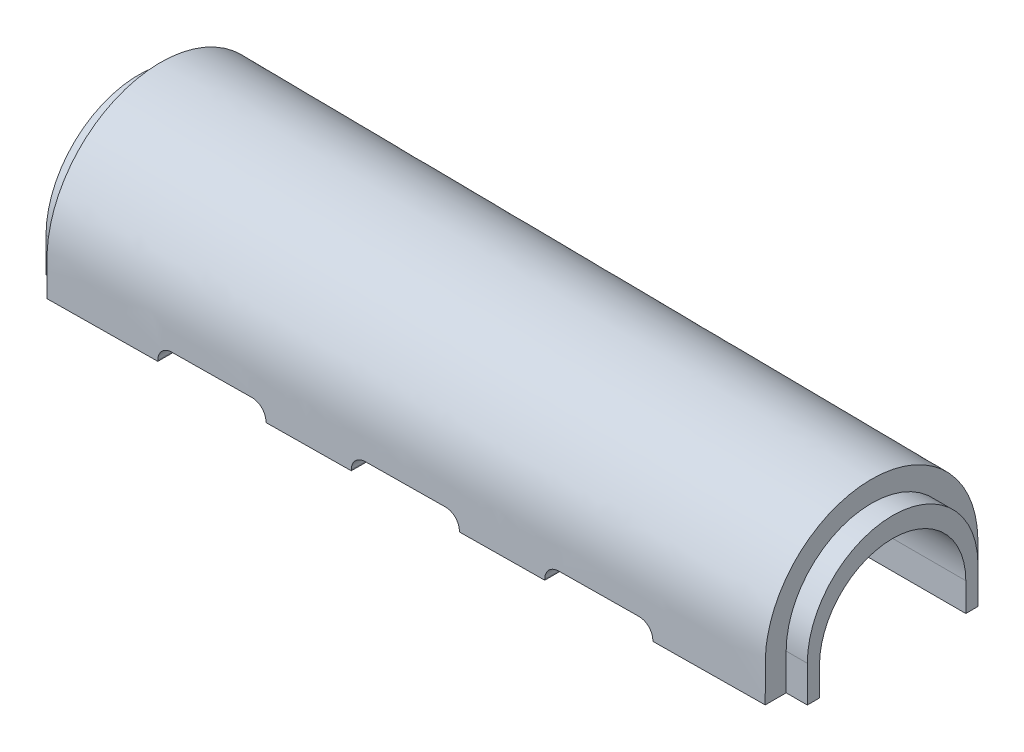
ISO-10303-21;
HEADER;
FILE_DESCRIPTION(('STEP AP214'),'2;1');
FILE_NAME('part.step','',(''),(''),'','','');
FILE_SCHEMA(('AUTOMOTIVE_DESIGN { 1 0 10303 214 1 1 1 1 }'));
ENDSEC;
DATA;
#1=APPLICATION_CONTEXT('core data for automotive mechanical design processes');
#2=APPLICATION_PROTOCOL_DEFINITION('international standard','automotive_design',2000,#1);
#3=PRODUCT_CONTEXT('',#1,'mechanical');
#4=PRODUCT('Part','Part','',(#3));
#5=PRODUCT_RELATED_PRODUCT_CATEGORY('part','',(#4));
#6=PRODUCT_DEFINITION_FORMATION('','',#4);
#7=PRODUCT_DEFINITION_CONTEXT('part definition',#1,'design');
#8=PRODUCT_DEFINITION('design','',#6,#7);
#9=PRODUCT_DEFINITION_SHAPE('','',#8);
#10=(LENGTH_UNIT() NAMED_UNIT(*) SI_UNIT(.MILLI.,.METRE.));
#11=(NAMED_UNIT(*) PLANE_ANGLE_UNIT() SI_UNIT($,.RADIAN.));
#12=(NAMED_UNIT(*) SI_UNIT($,.STERADIAN.) SOLID_ANGLE_UNIT());
#13=UNCERTAINTY_MEASURE_WITH_UNIT(LENGTH_MEASURE(1.E-05),#10,'distance_accuracy_value','');
#14=(GEOMETRIC_REPRESENTATION_CONTEXT(3) GLOBAL_UNCERTAINTY_ASSIGNED_CONTEXT((#13)) GLOBAL_UNIT_ASSIGNED_CONTEXT((#10,
#11,#12)) REPRESENTATION_CONTEXT('',''));
#15=CARTESIAN_POINT('',(0.,0.,0.));
#16=DIRECTION('',(0.,0.,1.));
#17=DIRECTION('',(1.,0.,0.));
#18=AXIS2_PLACEMENT_3D('',#15,#16,#17);
#19=CARTESIAN_POINT('',(0.,0.,0.));
#20=DIRECTION('',(0.,-1.,0.));
#21=DIRECTION('',(0.,0.,-1.));
#22=AXIS2_PLACEMENT_3D('',#19,#20,#21);
#23=PLANE('',#22);
#24=DIRECTION('',(1.,0.,0.));
#25=VECTOR('',#24,1.);
#26=CARTESIAN_POINT('',(-0.00979018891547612,0.,-6.34999999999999));
#27=LINE('',#26,#25);
#28=CARTESIAN_POINT('',(97.0026,0.,-6.34999999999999));
#29=VERTEX_POINT('',#28);
#30=CARTESIAN_POINT('',(117.6909,0.,-6.34999999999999));
#31=VERTEX_POINT('',#30);
#32=EDGE_CURVE('E1071',#29,#31,#27,.T.);
#33=ORIENTED_EDGE('',*,*,#32,.T.);
#34=DIRECTION('',(0.,0.,-1.));
#35=VECTOR('',#34,1.);
#36=CARTESIAN_POINT('',(117.6909,0.,-1.2065));
#37=LINE('',#36,#35);
#38=CARTESIAN_POINT('',(117.6909,0.,-4.445));
#39=VERTEX_POINT('',#38);
#40=EDGE_CURVE('E517',#39,#31,#37,.T.);
#41=ORIENTED_EDGE('',*,*,#40,.F.);
#42=DIRECTION('',(1.,0.,0.));
#43=VECTOR('',#42,1.);
#44=CARTESIAN_POINT('',(114.3889,0.,-4.445));
#45=LINE('',#44,#43);
#46=CARTESIAN_POINT('',(114.3889,0.,-4.445));
#47=VERTEX_POINT('',#46);
#48=EDGE_CURVE('E823',#47,#39,#45,.T.);
#49=ORIENTED_EDGE('',*,*,#48,.F.);
#50=DIRECTION('',(0.,0.,-1.));
#51=VECTOR('',#50,1.);
#52=CARTESIAN_POINT('',(114.3889,0.,0.));
#53=LINE('',#52,#51);
#54=CARTESIAN_POINT('',(114.3889,0.,-1.17264977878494));
#55=VERTEX_POINT('',#54);
#56=EDGE_CURVE('E839',#55,#47,#53,.T.);
#57=ORIENTED_EDGE('',*,*,#56,.F.);
#58=DIRECTION('',(-0.999947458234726,0.,0.0102508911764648));
#59=VECTOR('',#58,1.);
#60=CARTESIAN_POINT('',(58.84545,0.,-0.60325));
#61=LINE('',#60,#59);
#62=CARTESIAN_POINT('',(97.0026,0.,-0.99441534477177));
#63=VERTEX_POINT('',#62);
#64=EDGE_CURVE('E507',#55,#63,#61,.T.);
#65=ORIENTED_EDGE('',*,*,#64,.T.);
#66=DIRECTION('',(0.,0.,1.));
#67=VECTOR('',#66,1.);
#68=CARTESIAN_POINT('',(97.0026,0.,0.));
#69=LINE('',#68,#67);
#70=EDGE_CURVE('E803',#29,#63,#69,.T.);
#71=ORIENTED_EDGE('',*,*,#70,.F.);
#72=EDGE_LOOP('',(#33,#41,#49,#57,#65,#71));
#73=FACE_BOUND('',#72,.T.);
#74=ADVANCED_FACE('F96',(#73),#23,.T.);
#75=CARTESIAN_POINT('',(67.0814,0.,-6.34999999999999));
#76=VERTEX_POINT('',#75);
#77=CARTESIAN_POINT('',(80.2894,0.,-6.34999999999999));
#78=VERTEX_POINT('',#77);
#79=EDGE_CURVE('E1075',#76,#78,#27,.T.);
#80=ORIENTED_EDGE('',*,*,#79,.T.);
#81=DIRECTION('',(0.,0.,-1.));
#82=VECTOR('',#81,1.);
#83=CARTESIAN_POINT('',(80.2894,0.,0.));
#84=LINE('',#83,#82);
#85=CARTESIAN_POINT('',(80.2894,0.,-0.823081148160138));
#86=VERTEX_POINT('',#85);
#87=EDGE_CURVE('E796',#86,#78,#84,.T.);
#88=ORIENTED_EDGE('',*,*,#87,.F.);
#89=CARTESIAN_POINT('',(67.0814,0.,-0.687680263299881));
#90=VERTEX_POINT('',#89);
#91=EDGE_CURVE('E762',#86,#90,#61,.T.);
#92=ORIENTED_EDGE('',*,*,#91,.T.);
#93=DIRECTION('',(0.,0.,1.));
#94=VECTOR('',#93,1.);
#95=CARTESIAN_POINT('',(67.0814,0.,0.));
#96=LINE('',#95,#94);
#97=EDGE_CURVE('E779',#76,#90,#96,.T.);
#98=ORIENTED_EDGE('',*,*,#97,.F.);
#99=EDGE_LOOP('',(#80,#88,#92,#98));
#100=FACE_BOUND('',#99,.T.);
#101=ADVANCED_FACE('F1063',(#100),#23,.T.);
#102=CARTESIAN_POINT('',(37.1602,0.,-6.34999999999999));
#103=VERTEX_POINT('',#102);
#104=CARTESIAN_POINT('',(50.3682,0.,-6.34999999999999));
#105=VERTEX_POINT('',#104);
#106=EDGE_CURVE('E1078',#103,#105,#27,.T.);
#107=ORIENTED_EDGE('',*,*,#106,.T.);
#108=DIRECTION('',(0.,0.,-1.));
#109=VECTOR('',#108,1.);
#110=CARTESIAN_POINT('',(50.3682,0.,0.));
#111=LINE('',#110,#109);
#112=CARTESIAN_POINT('',(50.3682,0.,-0.516346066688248));
#113=VERTEX_POINT('',#112);
#114=EDGE_CURVE('E760',#113,#105,#111,.T.);
#115=ORIENTED_EDGE('',*,*,#114,.F.);
#116=CARTESIAN_POINT('',(37.1602,0.,-0.380945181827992));
#117=VERTEX_POINT('',#116);
#118=EDGE_CURVE('E757',#113,#117,#61,.T.);
#119=ORIENTED_EDGE('',*,*,#118,.T.);
#120=DIRECTION('',(0.,0.,1.));
#121=VECTOR('',#120,1.);
#122=CARTESIAN_POINT('',(37.1602,0.,0.));
#123=LINE('',#122,#121);
#124=EDGE_CURVE('E721',#103,#117,#123,.T.);
#125=ORIENTED_EDGE('',*,*,#124,.F.);
#126=EDGE_LOOP('',(#107,#115,#119,#125));
#127=FACE_BOUND('',#126,.T.);
#128=ADVANCED_FACE('F758',(#127),#23,.T.);
#129=DIRECTION('',(1.,0.,0.));
#130=VECTOR('',#129,1.);
#131=CARTESIAN_POINT('',(0.,0.,-3.18744801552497));
#132=LINE('',#131,#130);
#133=CARTESIAN_POINT('',(0.,0.,-3.18744801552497));
#134=VERTEX_POINT('',#133);
#135=CARTESIAN_POINT('',(3.302,0.,-3.18744801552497));
#136=VERTEX_POINT('',#135);
#137=EDGE_CURVE('E429',#134,#136,#132,.T.);
#138=ORIENTED_EDGE('',*,*,#137,.F.);
#139=DIRECTION('',(0.,0.,-1.));
#140=VECTOR('',#139,1.);
#141=CARTESIAN_POINT('',(0.,0.,0.));
#142=LINE('',#141,#140);
#143=CARTESIAN_POINT('',(0.,0.,-6.34999999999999));
#144=VERTEX_POINT('',#143);
#145=EDGE_CURVE('E609',#134,#144,#142,.T.);
#146=ORIENTED_EDGE('',*,*,#145,.T.);
#147=CARTESIAN_POINT('',(20.447,0.,-6.34999999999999));
#148=VERTEX_POINT('',#147);
#149=EDGE_CURVE('E925',#144,#148,#27,.T.);
#150=ORIENTED_EDGE('',*,*,#149,.T.);
#151=DIRECTION('',(0.,0.,-1.));
#152=VECTOR('',#151,1.);
#153=CARTESIAN_POINT('',(20.447,0.,0.));
#154=LINE('',#153,#152);
#155=CARTESIAN_POINT('',(20.447,0.,-0.209610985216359));
#156=VERTEX_POINT('',#155);
#157=EDGE_CURVE('E574',#156,#148,#154,.T.);
#158=ORIENTED_EDGE('',*,*,#157,.F.);
#159=CARTESIAN_POINT('',(3.302,0.,-0.0338502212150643));
#160=VERTEX_POINT('',#159);
#161=EDGE_CURVE('E526',#156,#160,#61,.T.);
#162=ORIENTED_EDGE('',*,*,#161,.T.);
#163=DIRECTION('',(0.,0.,1.));
#164=VECTOR('',#163,1.);
#165=CARTESIAN_POINT('',(3.302,0.,0.));
#166=LINE('',#165,#164);
#167=EDGE_CURVE('E459',#136,#160,#166,.T.);
#168=ORIENTED_EDGE('',*,*,#167,.F.);
#169=EDGE_LOOP('',(#138,#146,#150,#158,#162,#168));
#170=FACE_BOUND('',#169,.T.);
#171=ADVANCED_FACE('F1061',(#170),#23,.T.);
#172=CARTESIAN_POINT('',(20.447,-0.889,-35.5697901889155));
#173=DIRECTION('',(-1.,0.,0.));
#174=DIRECTION('',(0.,0.,1.));
#175=AXIS2_PLACEMENT_3D('',#172,#173,#174);
#176=PLANE('',#175);
#177=ORIENTED_EDGE('',*,*,#157,.T.);
#178=DIRECTION('',(0.,1.,0.));
#179=VECTOR('',#178,1.);
#180=CARTESIAN_POINT('',(20.447,-0.889,-6.34999999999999));
#181=LINE('',#180,#179);
#182=CARTESIAN_POINT('',(20.447,0.15239999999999,-6.34999999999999));
#183=VERTEX_POINT('',#182);
#184=EDGE_CURVE('E846',#148,#183,#181,.T.);
#185=ORIENTED_EDGE('',*,*,#184,.T.);
#186=DIRECTION('',(0.,0.,1.));
#187=VECTOR('',#186,1.);
#188=CARTESIAN_POINT('',(20.447,0.15239999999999,-35.5697901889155));
#189=LINE('',#188,#187);
#190=CARTESIAN_POINT('',(20.447,0.15239999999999,-0.209610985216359));
#191=VERTEX_POINT('',#190);
#192=EDGE_CURVE('E722',#183,#191,#189,.T.);
#193=ORIENTED_EDGE('',*,*,#192,.T.);
#194=CARTESIAN_POINT('',(20.447,0.15239999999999,-0.209610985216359));
#195=CARTESIAN_POINT('',(20.447,0.101599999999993,-0.209610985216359));
#196=CARTESIAN_POINT('',(20.447,0.0507999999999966,-0.209610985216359));
#197=CARTESIAN_POINT('',(20.447,0.,-0.209610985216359));
#198=B_SPLINE_CURVE_WITH_KNOTS('',3,(#194,#195,#196,#197),.UNSPECIFIED.,.F.,.F.,(4,4),(0.,
0.15239999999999),.UNSPECIFIED.);
#199=EDGE_CURVE('E969',#191,#156,#198,.T.);
#200=ORIENTED_EDGE('',*,*,#199,.T.);
#201=EDGE_LOOP('',(#177,#185,#193,#200));
#202=FACE_BOUND('',#201,.T.);
#203=ADVANCED_FACE('F1087',(#202),#176,.F.);
#204=CARTESIAN_POINT('',(22.606,0.1524,-35.5697901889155));
#205=DIRECTION('',(0.,0.,1.));
#206=DIRECTION('',(1.,0.,0.));
#207=AXIS2_PLACEMENT_3D('',#204,#205,#206);
#208=CYLINDRICAL_SURFACE('',#207,2.159);
#209=ORIENTED_EDGE('',*,*,#192,.F.);
#210=CARTESIAN_POINT('',(22.606,0.1524,-6.34999999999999));
#211=DIRECTION('',(0.,0.,1.));
#212=DIRECTION('',(1.,0.,0.));
#213=AXIS2_PLACEMENT_3D('',#210,#211,#212);
#214=CIRCLE('',#213,2.159);
#215=CARTESIAN_POINT('',(22.606,2.3114,-6.34999999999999));
#216=VERTEX_POINT('',#215);
#217=EDGE_CURVE('E849',#183,#216,#214,.F.);
#218=ORIENTED_EDGE('',*,*,#217,.T.);
#219=DIRECTION('',(0.,0.,1.));
#220=VECTOR('',#219,1.);
#221=CARTESIAN_POINT('',(22.606,2.3114,-35.5697901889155));
#222=LINE('',#221,#220);
#223=CARTESIAN_POINT('',(22.606,2.3114,-0.231743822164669));
#224=VERTEX_POINT('',#223);
#225=EDGE_CURVE('E736',#216,#224,#222,.T.);
#226=ORIENTED_EDGE('',*,*,#225,.T.);
#227=CARTESIAN_POINT('',(22.606,2.3114,-0.23174382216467));
#228=CARTESIAN_POINT('',(22.5452547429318,2.31139959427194,-0.231121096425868));
#229=CARTESIAN_POINT('',(22.4845385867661,2.30883471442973,-0.230498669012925));
#230=CARTESIAN_POINT('',(22.3635407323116,2.29860235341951,-0.229258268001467));
#231=CARTESIAN_POINT('',(22.3032590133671,2.29093511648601,-0.228640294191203));
#232=CARTESIAN_POINT('',(22.1238184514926,2.26035265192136,-0.226800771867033));
#233=CARTESIAN_POINT('',(22.005861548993,2.22985646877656,-0.225591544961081));
#234=CARTESIAN_POINT('',(21.7767448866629,2.14949357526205,-0.223242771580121));
#235=CARTESIAN_POINT('',(21.6655884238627,2.09961755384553,-0.222103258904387));
#236=CARTESIAN_POINT('',(21.4532297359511,1.98191566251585,-0.219926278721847));
#237=CARTESIAN_POINT('',(21.3520257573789,1.91409296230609,-0.218888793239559));
#238=CARTESIAN_POINT('',(21.1624471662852,1.76242346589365,-0.216945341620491));
#239=CARTESIAN_POINT('',(21.0740721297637,1.67857719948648,-0.216039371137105));
#240=CARTESIAN_POINT('',(20.9126341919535,1.49721647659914,-0.214384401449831));
#241=CARTESIAN_POINT('',(20.8395742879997,1.39969935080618,-0.213635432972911));
#242=CARTESIAN_POINT('',(20.710857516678,1.19377763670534,-0.212315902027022));
#243=CARTESIAN_POINT('',(20.6552031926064,1.08537146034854,-0.211745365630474));
#244=CARTESIAN_POINT('',(20.5629131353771,0.860774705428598,-0.210799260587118));
#245=CARTESIAN_POINT('',(20.526266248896,0.744588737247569,-0.210423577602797));
#246=CARTESIAN_POINT('',(20.4821428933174,0.548475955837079,-0.209971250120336));
#247=CARTESIAN_POINT('',(20.4689722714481,0.469783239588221,-0.209836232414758));
#248=CARTESIAN_POINT('',(20.4514019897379,0.311538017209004,-0.209656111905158));
#249=CARTESIAN_POINT('',(20.4469898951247,0.231986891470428,-0.20961088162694));
#250=CARTESIAN_POINT('',(20.447,0.152399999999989,-0.209610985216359));
#251=B_SPLINE_CURVE_WITH_KNOTS('',3,(#227,#228,#229,#230,#231,#232,#233,#234,#235,#236,#237,
#238,#239,#240,#241,#242,#243,#244,#245,#246,#247,#248,#249,#250),.UNSPECIFIED.,.F.,.F.,(4,2,2,
2,2,2,2,2,2,2,2,4),(0.,0.18213340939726,0.364258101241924,0.727907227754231,1.09173128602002,
1.45549112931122,1.81923894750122,2.18305788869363,2.54692996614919,2.91058828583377,
3.1494965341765,3.38806535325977),.UNSPECIFIED.);
#252=EDGE_CURVE('E679',#224,#191,#251,.T.);
#253=ORIENTED_EDGE('',*,*,#252,.T.);
#254=EDGE_LOOP('',(#209,#218,#226,#253));
#255=FACE_BOUND('',#254,.T.);
#256=ADVANCED_FACE('F1105',(#255),#208,.F.);
#257=CARTESIAN_POINT('',(22.606,2.3114,-35.5697901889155));
#258=DIRECTION('',(0.,1.,0.));
#259=DIRECTION('',(-1.,0.,0.));
#260=AXIS2_PLACEMENT_3D('',#257,#258,#259);
#261=PLANE('',#260);
#262=ORIENTED_EDGE('',*,*,#225,.F.);
#263=DIRECTION('',(1.,0.,0.));
#264=VECTOR('',#263,1.);
#265=CARTESIAN_POINT('',(22.606,2.3114,-6.34999999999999));
#266=LINE('',#265,#264);
#267=CARTESIAN_POINT('',(35.0012,2.3114,-6.34999999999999));
#268=VERTEX_POINT('',#267);
#269=EDGE_CURVE('E852',#216,#268,#266,.T.);
#270=ORIENTED_EDGE('',*,*,#269,.T.);
#271=DIRECTION('',(0.,0.,1.));
#272=VECTOR('',#271,1.);
#273=CARTESIAN_POINT('',(35.0012,2.3114,-35.5697901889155));
#274=LINE('',#273,#272);
#275=CARTESIAN_POINT('',(35.0012,2.3114,-0.35881234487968));
#276=VERTEX_POINT('',#275);
#277=EDGE_CURVE('E737',#268,#276,#274,.T.);
#278=ORIENTED_EDGE('',*,*,#277,.T.);
#279=CARTESIAN_POINT('',(35.0012,2.3114,-0.35881234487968));
#280=CARTESIAN_POINT('',(30.8694666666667,2.3114,-0.316456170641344));
#281=CARTESIAN_POINT('',(26.7377333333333,2.3114,-0.274099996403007));
#282=CARTESIAN_POINT('',(22.606,2.3114,-0.23174382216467));
#283=B_SPLINE_CURVE_WITH_KNOTS('',3,(#279,#280,#281,#282),.UNSPECIFIED.,.F.,.F.,(4,4),(0.,
12.3958512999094),.UNSPECIFIED.);
#284=EDGE_CURVE('E672',#276,#224,#283,.T.);
#285=ORIENTED_EDGE('',*,*,#284,.T.);
#286=EDGE_LOOP('',(#262,#270,#278,#285));
#287=FACE_BOUND('',#286,.T.);
#288=ADVANCED_FACE('F691',(#287),#261,.F.);
#289=CARTESIAN_POINT('',(35.0012,0.1524,-35.5697901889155));
#290=DIRECTION('',(0.,0.,1.));
#291=DIRECTION('',(1.,0.,0.));
#292=AXIS2_PLACEMENT_3D('',#289,#290,#291);
#293=CYLINDRICAL_SURFACE('',#292,2.159);
#294=ORIENTED_EDGE('',*,*,#277,.F.);
#295=CARTESIAN_POINT('',(35.0012,0.1524,-6.34999999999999));
#296=DIRECTION('',(0.,0.,1.));
#297=DIRECTION('',(1.,0.,0.));
#298=AXIS2_PLACEMENT_3D('',#295,#296,#297);
#299=CIRCLE('',#298,2.159);
#300=CARTESIAN_POINT('',(37.1602,0.152399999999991,-6.34999999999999));
#301=VERTEX_POINT('',#300);
#302=EDGE_CURVE('E770',#268,#301,#299,.F.);
#303=ORIENTED_EDGE('',*,*,#302,.T.);
#304=DIRECTION('',(0.,0.,1.));
#305=VECTOR('',#304,1.);
#306=CARTESIAN_POINT('',(37.1602,0.152399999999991,-35.5697901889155));
#307=LINE('',#306,#305);
#308=CARTESIAN_POINT('',(37.1602,0.152399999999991,-0.380945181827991));
#309=VERTEX_POINT('',#308);
#310=EDGE_CURVE('E742',#301,#309,#307,.T.);
#311=ORIENTED_EDGE('',*,*,#310,.T.);
#312=CARTESIAN_POINT('',(37.1602,0.152399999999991,-0.380945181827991));
#313=CARTESIAN_POINT('',(37.1601995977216,0.213140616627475,-0.380945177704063));
#314=CARTESIAN_POINT('',(37.1576351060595,0.273852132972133,-0.380918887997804));
#315=CARTESIAN_POINT('',(37.1474043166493,0.394840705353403,-0.380814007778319));
#316=CARTESIAN_POINT('',(37.1397382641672,0.455117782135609,-0.38073541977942));
#317=CARTESIAN_POINT('',(37.1091606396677,0.634544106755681,-0.38042195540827));
#318=CARTESIAN_POINT('',(37.0786693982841,0.752491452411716,-0.380109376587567));
#319=CARTESIAN_POINT('',(36.9983202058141,0.981589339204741,-0.379285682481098));
#320=CARTESIAN_POINT('',(36.9484529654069,1.09273659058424,-0.378774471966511));
#321=CARTESIAN_POINT('',(36.8307728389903,1.30507818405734,-0.377568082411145));
#322=CARTESIAN_POINT('',(36.7629631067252,1.40627427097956,-0.376872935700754));
#323=CARTESIAN_POINT('',(36.6113204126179,1.59584394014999,-0.37531838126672));
#324=CARTESIAN_POINT('',(36.5274872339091,1.68421734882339,-0.374458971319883));
#325=CARTESIAN_POINT('',(36.3461556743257,1.84565445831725,-0.37260006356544));
#326=CARTESIAN_POINT('',(36.2486546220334,1.91871515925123,-0.371600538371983));
#327=CARTESIAN_POINT('',(36.042757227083,2.0474437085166,-0.369489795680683));
#328=CARTESIAN_POINT('',(35.9343582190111,2.1031072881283,-0.368378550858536));
#329=CARTESIAN_POINT('',(35.7097756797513,2.19541701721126,-0.366076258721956));
#330=CARTESIAN_POINT('',(35.5935967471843,2.23207429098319,-0.364885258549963));
#331=CARTESIAN_POINT('',(35.3974562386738,2.27622486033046,-0.362874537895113));
#332=CARTESIAN_POINT('',(35.3187281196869,2.28940756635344,-0.362067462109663));
#333=CARTESIAN_POINT('',(35.1604109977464,2.306993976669,-0.360444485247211));
#334=CARTESIAN_POINT('',(35.0808233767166,2.31141012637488,-0.359628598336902));
#335=CARTESIAN_POINT('',(35.0012,2.3114,-0.35881234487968));
#336=B_SPLINE_CURVE_WITH_KNOTS('',3,(#312,#313,#314,#315,#316,#317,#318,#319,#320,#321,#322,
#323,#324,#325,#326,#327,#328,#329,#330,#331,#332,#333,#334,#335),.UNSPECIFIED.,.F.,.F.,(4,2,2,
2,2,2,2,2,2,2,2,4),(0.,0.182109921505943,0.364211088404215,0.727812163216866,1.09158777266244,
1.45529948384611,1.81901611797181,2.1828039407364,2.54668095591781,2.91034475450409,
3.14937503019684,3.3880657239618),.UNSPECIFIED.);
#337=EDGE_CURVE('E659',#309,#276,#336,.T.);
#338=ORIENTED_EDGE('',*,*,#337,.T.);
#339=EDGE_LOOP('',(#294,#303,#311,#338));
#340=FACE_BOUND('',#339,.T.);
#341=ADVANCED_FACE('F768',(#340),#293,.F.);
#342=CARTESIAN_POINT('',(37.1602,-0.889,-35.5697901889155));
#343=DIRECTION('',(1.,0.,0.));
#344=DIRECTION('',(0.,0.,-1.));
#345=AXIS2_PLACEMENT_3D('',#342,#343,#344);
#346=PLANE('',#345);
#347=ORIENTED_EDGE('',*,*,#310,.F.);
#348=DIRECTION('',(0.,-1.,0.));
#349=VECTOR('',#348,1.);
#350=CARTESIAN_POINT('',(37.1602,-0.889,-6.34999999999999));
#351=LINE('',#350,#349);
#352=EDGE_CURVE('E752',#301,#103,#351,.T.);
#353=ORIENTED_EDGE('',*,*,#352,.T.);
#354=ORIENTED_EDGE('',*,*,#124,.T.);
#355=CARTESIAN_POINT('',(37.1602,0.,-0.380945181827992));
#356=CARTESIAN_POINT('',(37.1602,0.0507999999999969,-0.380945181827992));
#357=CARTESIAN_POINT('',(37.1602,0.101599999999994,-0.380945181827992));
#358=CARTESIAN_POINT('',(37.1602,0.152399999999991,-0.380945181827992));
#359=B_SPLINE_CURVE_WITH_KNOTS('',3,(#355,#356,#357,#358),.UNSPECIFIED.,.F.,.F.,(4,4),(0.,
0.152399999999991),.UNSPECIFIED.);
#360=EDGE_CURVE('E651',#117,#309,#359,.T.);
#361=ORIENTED_EDGE('',*,*,#360,.T.);
#362=EDGE_LOOP('',(#347,#353,#354,#361));
#363=FACE_BOUND('',#362,.T.);
#364=ADVANCED_FACE('F644',(#363),#346,.F.);
#365=CARTESIAN_POINT('',(50.3682,-0.889,-35.5697901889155));
#366=DIRECTION('',(-1.,0.,0.));
#367=DIRECTION('',(0.,0.,1.));
#368=AXIS2_PLACEMENT_3D('',#365,#366,#367);
#369=PLANE('',#368);
#370=ORIENTED_EDGE('',*,*,#114,.T.);
#371=DIRECTION('',(0.,1.,0.));
#372=VECTOR('',#371,1.);
#373=CARTESIAN_POINT('',(50.3682,-0.889,-6.34999999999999));
#374=LINE('',#373,#372);
#375=CARTESIAN_POINT('',(50.3682,0.152399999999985,-6.34999999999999));
#376=VERTEX_POINT('',#375);
#377=EDGE_CURVE('E857',#105,#376,#374,.T.);
#378=ORIENTED_EDGE('',*,*,#377,.T.);
#379=DIRECTION('',(0.,0.,1.));
#380=VECTOR('',#379,1.);
#381=CARTESIAN_POINT('',(50.3682,0.152399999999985,-35.5697901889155));
#382=LINE('',#381,#380);
#383=CARTESIAN_POINT('',(50.3682,0.152399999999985,-0.516346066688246));
#384=VERTEX_POINT('',#383);
#385=EDGE_CURVE('E792',#376,#384,#382,.T.);
#386=ORIENTED_EDGE('',*,*,#385,.T.);
#387=CARTESIAN_POINT('',(50.3682,0.152399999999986,-0.516346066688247));
#388=CARTESIAN_POINT('',(50.3682,0.10159999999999,-0.516346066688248));
#389=CARTESIAN_POINT('',(50.3682,0.0507999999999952,-0.516346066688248));
#390=CARTESIAN_POINT('',(50.3682,0.,-0.516346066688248));
#391=B_SPLINE_CURVE_WITH_KNOTS('',3,(#387,#388,#389,#390),.UNSPECIFIED.,.F.,.F.,(4,4),(0.,
0.152399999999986),.UNSPECIFIED.);
#392=EDGE_CURVE('E1492',#384,#113,#391,.T.);
#393=ORIENTED_EDGE('',*,*,#392,.T.);
#394=EDGE_LOOP('',(#370,#378,#386,#393));
#395=FACE_BOUND('',#394,.T.);
#396=ADVANCED_FACE('F1231',(#395),#369,.F.);
#397=CARTESIAN_POINT('',(52.5272,0.1524,-35.5697901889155));
#398=DIRECTION('',(0.,0.,1.));
#399=DIRECTION('',(1.,0.,0.));
#400=AXIS2_PLACEMENT_3D('',#397,#398,#399);
#401=CYLINDRICAL_SURFACE('',#400,2.159);
#402=ORIENTED_EDGE('',*,*,#385,.F.);
#403=CARTESIAN_POINT('',(52.5272,0.1524,-6.34999999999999));
#404=DIRECTION('',(0.,0.,1.));
#405=DIRECTION('',(1.,0.,0.));
#406=AXIS2_PLACEMENT_3D('',#403,#404,#405);
#407=CIRCLE('',#406,2.159);
#408=CARTESIAN_POINT('',(52.5272,2.3114,-6.34999999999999));
#409=VERTEX_POINT('',#408);
#410=EDGE_CURVE('E859',#376,#409,#407,.F.);
#411=ORIENTED_EDGE('',*,*,#410,.T.);
#412=DIRECTION('',(0.,0.,1.));
#413=VECTOR('',#412,1.);
#414=CARTESIAN_POINT('',(52.5272,2.3114,-35.5697901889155));
#415=LINE('',#414,#413);
#416=CARTESIAN_POINT('',(52.5272,2.3114,-0.538478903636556));
#417=VERTEX_POINT('',#416);
#418=EDGE_CURVE('E788',#409,#417,#415,.T.);
#419=ORIENTED_EDGE('',*,*,#418,.T.);
#420=CARTESIAN_POINT('',(52.5272,2.3114,-0.538478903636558));
#421=CARTESIAN_POINT('',(52.4664547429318,2.31139959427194,-0.537856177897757));
#422=CARTESIAN_POINT('',(52.4057385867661,2.30883471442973,-0.537233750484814));
#423=CARTESIAN_POINT('',(52.2847407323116,2.29860235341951,-0.535993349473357));
#424=CARTESIAN_POINT('',(52.2244590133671,2.29093511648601,-0.535375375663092));
#425=CARTESIAN_POINT('',(52.0450184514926,2.26035265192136,-0.533535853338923));
#426=CARTESIAN_POINT('',(51.927061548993,2.22985646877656,-0.53232662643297));
#427=CARTESIAN_POINT('',(51.697944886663,2.14949357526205,-0.52997785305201));
#428=CARTESIAN_POINT('',(51.5867884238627,2.09961755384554,-0.528838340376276));
#429=CARTESIAN_POINT('',(51.3744297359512,1.98191566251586,-0.526661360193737));
#430=CARTESIAN_POINT('',(51.2732257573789,1.9140929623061,-0.525623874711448));
#431=CARTESIAN_POINT('',(51.0836471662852,1.76242346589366,-0.523680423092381));
#432=CARTESIAN_POINT('',(50.9952721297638,1.6785771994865,-0.522774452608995));
#433=CARTESIAN_POINT('',(50.8338341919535,1.49721647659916,-0.521119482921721));
#434=CARTESIAN_POINT('',(50.7607742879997,1.3996993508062,-0.520370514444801));
#435=CARTESIAN_POINT('',(50.632057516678,1.19377763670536,-0.519050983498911));
#436=CARTESIAN_POINT('',(50.5764031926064,1.08537146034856,-0.518480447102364));
#437=CARTESIAN_POINT('',(50.4841131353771,0.860774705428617,-0.517534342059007));
#438=CARTESIAN_POINT('',(50.4474662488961,0.744588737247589,-0.517158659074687));
#439=CARTESIAN_POINT('',(50.4033428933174,0.548475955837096,-0.516706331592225));
#440=CARTESIAN_POINT('',(50.3901722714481,0.469783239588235,-0.516571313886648));
#441=CARTESIAN_POINT('',(50.3726019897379,0.311538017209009,-0.516391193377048));
#442=CARTESIAN_POINT('',(50.3681898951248,0.23198689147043,-0.516345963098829));
#443=CARTESIAN_POINT('',(50.3682,0.152399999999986,-0.516346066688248));
#444=B_SPLINE_CURVE_WITH_KNOTS('',3,(#420,#421,#422,#423,#424,#425,#426,#427,#428,#429,#430,
#431,#432,#433,#434,#435,#436,#437,#438,#439,#440,#441,#442,#443),.UNSPECIFIED.,.F.,.F.,(4,2,2,
2,2,2,2,2,2,2,2,4),(0.,0.182133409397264,0.364258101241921,0.72790722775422,1.09173128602,
1.45549112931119,1.81923894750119,2.18305788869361,2.54692996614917,2.91058828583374,
3.14949653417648,3.38806535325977),.UNSPECIFIED.);
#445=EDGE_CURVE('E1015',#417,#384,#444,.T.);
#446=ORIENTED_EDGE('',*,*,#445,.T.);
#447=EDGE_LOOP('',(#402,#411,#419,#446));
#448=FACE_BOUND('',#447,.T.);
#449=ADVANCED_FACE('F1226',(#448),#401,.F.);
#450=CARTESIAN_POINT('',(52.5272,2.3114,-35.5697901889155));
#451=DIRECTION('',(0.,1.,0.));
#452=DIRECTION('',(-1.,0.,0.));
#453=AXIS2_PLACEMENT_3D('',#450,#451,#452);
#454=PLANE('',#453);
#455=ORIENTED_EDGE('',*,*,#418,.F.);
#456=DIRECTION('',(1.,0.,0.));
#457=VECTOR('',#456,1.);
#458=CARTESIAN_POINT('',(52.5272,2.3114,-6.34999999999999));
#459=LINE('',#458,#457);
#460=CARTESIAN_POINT('',(64.9224,2.3114,-6.34999999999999));
#461=VERTEX_POINT('',#460);
#462=EDGE_CURVE('E862',#409,#461,#459,.T.);
#463=ORIENTED_EDGE('',*,*,#462,.T.);
#464=DIRECTION('',(0.,0.,1.));
#465=VECTOR('',#464,1.);
#466=CARTESIAN_POINT('',(64.9224,2.3114,-35.5697901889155));
#467=LINE('',#466,#465);
#468=CARTESIAN_POINT('',(64.9224,2.3114,-0.665547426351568));
#469=VERTEX_POINT('',#468);
#470=EDGE_CURVE('E783',#461,#469,#467,.T.);
#471=ORIENTED_EDGE('',*,*,#470,.T.);
#472=CARTESIAN_POINT('',(64.9224,2.3114,-0.665547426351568));
#473=CARTESIAN_POINT('',(60.7906666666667,2.3114,-0.623191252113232));
#474=CARTESIAN_POINT('',(56.6589333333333,2.3114,-0.580835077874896));
#475=CARTESIAN_POINT('',(52.5272,2.3114,-0.538478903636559));
#476=B_SPLINE_CURVE_WITH_KNOTS('',3,(#472,#473,#474,#475),.UNSPECIFIED.,.F.,.F.,(4,4),(0.,
12.3958512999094),.UNSPECIFIED.);
#477=EDGE_CURVE('E1008',#469,#417,#476,.T.);
#478=ORIENTED_EDGE('',*,*,#477,.T.);
#479=EDGE_LOOP('',(#455,#463,#471,#478));
#480=FACE_BOUND('',#479,.T.);
#481=ADVANCED_FACE('F1027',(#480),#454,.F.);
#482=CARTESIAN_POINT('',(64.9224,0.1524,-35.5697901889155));
#483=DIRECTION('',(0.,0.,1.));
#484=DIRECTION('',(1.,0.,0.));
#485=AXIS2_PLACEMENT_3D('',#482,#483,#484);
#486=CYLINDRICAL_SURFACE('',#485,2.159);
#487=ORIENTED_EDGE('',*,*,#470,.F.);
#488=CARTESIAN_POINT('',(64.9224,0.1524,-6.34999999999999));
#489=DIRECTION('',(0.,0.,1.));
#490=DIRECTION('',(1.,0.,0.));
#491=AXIS2_PLACEMENT_3D('',#488,#489,#490);
#492=CIRCLE('',#491,2.159);
#493=CARTESIAN_POINT('',(67.0814,0.152399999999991,-6.34999999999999));
#494=VERTEX_POINT('',#493);
#495=EDGE_CURVE('E865',#461,#494,#492,.F.);
#496=ORIENTED_EDGE('',*,*,#495,.T.);
#497=DIRECTION('',(0.,0.,1.));
#498=VECTOR('',#497,1.);
#499=CARTESIAN_POINT('',(67.0814,0.152399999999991,-35.5697901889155));
#500=LINE('',#499,#498);
#501=CARTESIAN_POINT('',(67.0814,0.152399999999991,-0.687680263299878));
#502=VERTEX_POINT('',#501);
#503=EDGE_CURVE('E784',#494,#502,#500,.T.);
#504=ORIENTED_EDGE('',*,*,#503,.T.);
#505=CARTESIAN_POINT('',(67.0814,0.152399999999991,-0.68768026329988));
#506=CARTESIAN_POINT('',(67.0813995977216,0.213140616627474,-0.687680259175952));
#507=CARTESIAN_POINT('',(67.0788351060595,0.273852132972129,-0.687653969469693));
#508=CARTESIAN_POINT('',(67.0686043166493,0.394840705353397,-0.687549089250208));
#509=CARTESIAN_POINT('',(67.0609382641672,0.455117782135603,-0.687470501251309));
#510=CARTESIAN_POINT('',(67.0303606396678,0.634544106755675,-0.687157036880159));
#511=CARTESIAN_POINT('',(66.9998693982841,0.752491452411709,-0.686844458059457));
#512=CARTESIAN_POINT('',(66.9195202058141,0.981589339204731,-0.686020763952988));
#513=CARTESIAN_POINT('',(66.8696529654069,1.09273659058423,-0.6855095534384));
#514=CARTESIAN_POINT('',(66.7519728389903,1.30507818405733,-0.684303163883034));
#515=CARTESIAN_POINT('',(66.6841631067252,1.40627427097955,-0.683608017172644));
#516=CARTESIAN_POINT('',(66.5325204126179,1.59584394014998,-0.68205346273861));
#517=CARTESIAN_POINT('',(66.4486872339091,1.68421734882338,-0.681194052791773));
#518=CARTESIAN_POINT('',(66.2673556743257,1.84565445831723,-0.67933514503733));
#519=CARTESIAN_POINT('',(66.1698546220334,1.91871515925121,-0.678335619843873));
#520=CARTESIAN_POINT('',(65.9639572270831,2.04744370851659,-0.676224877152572));
#521=CARTESIAN_POINT('',(65.8555582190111,2.10310728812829,-0.675113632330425));
#522=CARTESIAN_POINT('',(65.6309756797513,2.19541701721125,-0.672811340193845));
#523=CARTESIAN_POINT('',(65.5147967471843,2.23207429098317,-0.671620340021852));
#524=CARTESIAN_POINT('',(65.3186562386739,2.27622486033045,-0.669609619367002));
#525=CARTESIAN_POINT('',(65.2399281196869,2.28940756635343,-0.668802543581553));
#526=CARTESIAN_POINT('',(65.0816109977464,2.30699397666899,-0.667179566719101));
#527=CARTESIAN_POINT('',(65.0020233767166,2.31141012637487,-0.666363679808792));
#528=CARTESIAN_POINT('',(64.9224,2.3114,-0.66554742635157));
#529=B_SPLINE_CURVE_WITH_KNOTS('',3,(#505,#506,#507,#508,#509,#510,#511,#512,#513,#514,#515,
#516,#517,#518,#519,#520,#521,#522,#523,#524,#525,#526,#527,#528),.UNSPECIFIED.,.F.,.F.,(4,2,2,
2,2,2,2,2,2,2,2,4),(0.,0.182109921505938,0.364211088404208,0.727812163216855,1.09158777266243,
1.45529948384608,1.81901611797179,2.18280394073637,2.54668095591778,2.91034475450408,
3.14937503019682,3.38806572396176),.UNSPECIFIED.);
#530=EDGE_CURVE('E995',#502,#469,#529,.T.);
#531=ORIENTED_EDGE('',*,*,#530,.T.);
#532=EDGE_LOOP('',(#487,#496,#504,#531));
#533=FACE_BOUND('',#532,.T.);
#534=ADVANCED_FACE('F1215',(#533),#486,.F.);
#535=CARTESIAN_POINT('',(67.0814,-0.889,-35.5697901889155));
#536=DIRECTION('',(1.,0.,0.));
#537=DIRECTION('',(0.,0.,-1.));
#538=AXIS2_PLACEMENT_3D('',#535,#536,#537);
#539=PLANE('',#538);
#540=ORIENTED_EDGE('',*,*,#503,.F.);
#541=DIRECTION('',(0.,-1.,0.));
#542=VECTOR('',#541,1.);
#543=CARTESIAN_POINT('',(67.0814,-0.889,-6.34999999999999));
#544=LINE('',#543,#542);
#545=EDGE_CURVE('E868',#494,#76,#544,.T.);
#546=ORIENTED_EDGE('',*,*,#545,.T.);
#547=ORIENTED_EDGE('',*,*,#97,.T.);
#548=CARTESIAN_POINT('',(67.0814,0.,-0.687680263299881));
#549=CARTESIAN_POINT('',(67.0814,0.0507999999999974,-0.687680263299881));
#550=CARTESIAN_POINT('',(67.0814,0.101599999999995,-0.687680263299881));
#551=CARTESIAN_POINT('',(67.0814,0.152399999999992,-0.687680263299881));
#552=B_SPLINE_CURVE_WITH_KNOTS('',3,(#548,#549,#550,#551),.UNSPECIFIED.,.F.,.F.,(4,4),(0.,
0.152399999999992),.UNSPECIFIED.);
#553=EDGE_CURVE('E987',#90,#502,#552,.T.);
#554=ORIENTED_EDGE('',*,*,#553,.T.);
#555=EDGE_LOOP('',(#540,#546,#547,#554));
#556=FACE_BOUND('',#555,.T.);
#557=ADVANCED_FACE('F981',(#556),#539,.F.);
#558=CARTESIAN_POINT('',(80.2894,-0.889,-35.5697901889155));
#559=DIRECTION('',(-1.,0.,0.));
#560=DIRECTION('',(0.,0.,1.));
#561=AXIS2_PLACEMENT_3D('',#558,#559,#560);
#562=PLANE('',#561);
#563=ORIENTED_EDGE('',*,*,#87,.T.);
#564=DIRECTION('',(0.,1.,0.));
#565=VECTOR('',#564,1.);
#566=CARTESIAN_POINT('',(80.2894,-0.889,-6.34999999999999));
#567=LINE('',#566,#565);
#568=CARTESIAN_POINT('',(80.2894,0.152399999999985,-6.34999999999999));
#569=VERTEX_POINT('',#568);
#570=EDGE_CURVE('E871',#78,#569,#567,.T.);
#571=ORIENTED_EDGE('',*,*,#570,.T.);
#572=DIRECTION('',(0.,0.,1.));
#573=VECTOR('',#572,1.);
#574=CARTESIAN_POINT('',(80.2894,0.152399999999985,-35.5697901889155));
#575=LINE('',#574,#573);
#576=CARTESIAN_POINT('',(80.2894,0.152399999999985,-0.82308114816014));
#577=VERTEX_POINT('',#576);
#578=EDGE_CURVE('E816',#569,#577,#575,.T.);
#579=ORIENTED_EDGE('',*,*,#578,.T.);
#580=CARTESIAN_POINT('',(80.2894,0.152399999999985,-0.823081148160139));
#581=CARTESIAN_POINT('',(80.2894,0.10159999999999,-0.823081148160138));
#582=CARTESIAN_POINT('',(80.2894,0.0507999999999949,-0.823081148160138));
#583=CARTESIAN_POINT('',(80.2894,0.,-0.823081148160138));
#584=B_SPLINE_CURVE_WITH_KNOTS('',3,(#580,#581,#582,#583),.UNSPECIFIED.,.F.,.F.,(4,4),(0.,
0.152399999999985),.UNSPECIFIED.);
#585=EDGE_CURVE('E506',#577,#86,#584,.T.);
#586=ORIENTED_EDGE('',*,*,#585,.T.);
#587=EDGE_LOOP('',(#563,#571,#579,#586));
#588=FACE_BOUND('',#587,.T.);
#589=ADVANCED_FACE('F1205',(#588),#562,.F.);
#590=CARTESIAN_POINT('',(82.4484,0.1524,-35.5697901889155));
#591=DIRECTION('',(0.,0.,1.));
#592=DIRECTION('',(1.,0.,0.));
#593=AXIS2_PLACEMENT_3D('',#590,#591,#592);
#594=CYLINDRICAL_SURFACE('',#593,2.159);
#595=ORIENTED_EDGE('',*,*,#578,.F.);
#596=CARTESIAN_POINT('',(82.4484,0.1524,-6.34999999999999));
#597=DIRECTION('',(0.,0.,1.));
#598=DIRECTION('',(1.,0.,0.));
#599=AXIS2_PLACEMENT_3D('',#596,#597,#598);
#600=CIRCLE('',#599,2.159);
#601=CARTESIAN_POINT('',(82.4484,2.3114,-6.34999999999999));
#602=VERTEX_POINT('',#601);
#603=EDGE_CURVE('E874',#569,#602,#600,.F.);
#604=ORIENTED_EDGE('',*,*,#603,.T.);
#605=DIRECTION('',(0.,0.,1.));
#606=VECTOR('',#605,1.);
#607=CARTESIAN_POINT('',(82.4484,2.3114,-35.5697901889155));
#608=LINE('',#607,#606);
#609=CARTESIAN_POINT('',(82.4484,2.3114,-0.845213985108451));
#610=VERTEX_POINT('',#609);
#611=EDGE_CURVE('E812',#602,#610,#608,.T.);
#612=ORIENTED_EDGE('',*,*,#611,.T.);
#613=CARTESIAN_POINT('',(82.4484,2.3114,-0.84521398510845));
#614=CARTESIAN_POINT('',(82.3876547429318,2.31139959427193,-0.844591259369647));
#615=CARTESIAN_POINT('',(82.3269385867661,2.30883471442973,-0.843968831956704));
#616=CARTESIAN_POINT('',(82.2059407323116,2.29860235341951,-0.842728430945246));
#617=CARTESIAN_POINT('',(82.1456590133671,2.29093511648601,-0.842110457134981));
#618=CARTESIAN_POINT('',(81.9662184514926,2.26035265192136,-0.840270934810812));
#619=CARTESIAN_POINT('',(81.8482615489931,2.22985646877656,-0.839061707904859));
#620=CARTESIAN_POINT('',(81.619144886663,2.14949357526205,-0.836712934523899));
#621=CARTESIAN_POINT('',(81.5079884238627,2.09961755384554,-0.835573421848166));
#622=CARTESIAN_POINT('',(81.2956297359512,1.98191566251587,-0.833396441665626));
#623=CARTESIAN_POINT('',(81.1944257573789,1.91409296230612,-0.832358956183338));
#624=CARTESIAN_POINT('',(81.0048471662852,1.76242346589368,-0.83041550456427));
#625=CARTESIAN_POINT('',(80.9164721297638,1.67857719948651,-0.829509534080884));
#626=CARTESIAN_POINT('',(80.7550341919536,1.49721647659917,-0.82785456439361));
#627=CARTESIAN_POINT('',(80.6819742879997,1.39969935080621,-0.82710559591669));
#628=CARTESIAN_POINT('',(80.553257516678,1.19377763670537,-0.825786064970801));
#629=CARTESIAN_POINT('',(80.4976031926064,1.08537146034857,-0.825215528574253));
#630=CARTESIAN_POINT('',(80.4053131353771,0.860774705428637,-0.824269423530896));
#631=CARTESIAN_POINT('',(80.3686662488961,0.744588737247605,-0.823893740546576));
#632=CARTESIAN_POINT('',(80.3245428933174,0.548475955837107,-0.823441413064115));
#633=CARTESIAN_POINT('',(80.3113722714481,0.469783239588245,-0.823306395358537));
#634=CARTESIAN_POINT('',(80.2938019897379,0.311538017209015,-0.823126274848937));
#635=CARTESIAN_POINT('',(80.2893898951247,0.231986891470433,-0.823081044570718));
#636=CARTESIAN_POINT('',(80.2894,0.152399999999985,-0.823081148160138));
#637=B_SPLINE_CURVE_WITH_KNOTS('',3,(#613,#614,#615,#616,#617,#618,#619,#620,#621,#622,#623,
#624,#625,#626,#627,#628,#629,#630,#631,#632,#633,#634,#635,#636),.UNSPECIFIED.,.F.,.F.,(4,2,2,
2,2,2,2,2,2,2,2,4),(0.,0.18213340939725,0.364258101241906,0.727907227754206,1.09173128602,
1.45549112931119,1.81923894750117,2.18305788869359,2.54692996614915,2.91058828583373,
3.14949653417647,3.38806535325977),.UNSPECIFIED.);
#638=EDGE_CURVE('E1545',#610,#577,#637,.T.);
#639=ORIENTED_EDGE('',*,*,#638,.T.);
#640=EDGE_LOOP('',(#595,#604,#612,#639));
#641=FACE_BOUND('',#640,.T.);
#642=ADVANCED_FACE('F1200',(#641),#594,.F.);
#643=CARTESIAN_POINT('',(82.4484,2.3114,-35.5697901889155));
#644=DIRECTION('',(0.,1.,0.));
#645=DIRECTION('',(-1.,0.,0.));
#646=AXIS2_PLACEMENT_3D('',#643,#644,#645);
#647=PLANE('',#646);
#648=ORIENTED_EDGE('',*,*,#611,.F.);
#649=DIRECTION('',(1.,0.,0.));
#650=VECTOR('',#649,1.);
#651=CARTESIAN_POINT('',(82.4484,2.3114,-6.34999999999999));
#652=LINE('',#651,#650);
#653=CARTESIAN_POINT('',(94.8436,2.3114,-6.34999999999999));
#654=VERTEX_POINT('',#653);
#655=EDGE_CURVE('E877',#602,#654,#652,.T.);
#656=ORIENTED_EDGE('',*,*,#655,.T.);
#657=DIRECTION('',(0.,0.,1.));
#658=VECTOR('',#657,1.);
#659=CARTESIAN_POINT('',(94.8436,2.3114,-35.5697901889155));
#660=LINE('',#659,#658);
#661=CARTESIAN_POINT('',(94.8436,2.3114,-0.972282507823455));
#662=VERTEX_POINT('',#661);
#663=EDGE_CURVE('E807',#654,#662,#660,.T.);
#664=ORIENTED_EDGE('',*,*,#663,.T.);
#665=CARTESIAN_POINT('',(94.8436,2.3114,-0.97228250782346));
#666=CARTESIAN_POINT('',(90.7118666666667,2.3114,-0.929926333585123));
#667=CARTESIAN_POINT('',(86.5801333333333,2.3114,-0.887570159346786));
#668=CARTESIAN_POINT('',(82.4484,2.3114,-0.845213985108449));
#669=B_SPLINE_CURVE_WITH_KNOTS('',3,(#665,#666,#667,#668),.UNSPECIFIED.,.F.,.F.,(4,4),(0.,
12.3958512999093),.UNSPECIFIED.);
#670=EDGE_CURVE('E1538',#662,#610,#669,.T.);
#671=ORIENTED_EDGE('',*,*,#670,.T.);
#672=EDGE_LOOP('',(#648,#656,#664,#671));
#673=FACE_BOUND('',#672,.T.);
#674=ADVANCED_FACE('F1192',(#673),#647,.F.);
#675=CARTESIAN_POINT('',(94.8436,0.1524,-35.5697901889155));
#676=DIRECTION('',(0.,0.,1.));
#677=DIRECTION('',(1.,0.,0.));
#678=AXIS2_PLACEMENT_3D('',#675,#676,#677);
#679=CYLINDRICAL_SURFACE('',#678,2.159);
#680=ORIENTED_EDGE('',*,*,#663,.F.);
#681=CARTESIAN_POINT('',(94.8436,0.1524,-6.34999999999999));
#682=DIRECTION('',(0.,0.,1.));
#683=DIRECTION('',(1.,0.,0.));
#684=AXIS2_PLACEMENT_3D('',#681,#682,#683);
#685=CIRCLE('',#684,2.159);
#686=CARTESIAN_POINT('',(97.0026,0.152399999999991,-6.34999999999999));
#687=VERTEX_POINT('',#686);
#688=EDGE_CURVE('E880',#654,#687,#685,.F.);
#689=ORIENTED_EDGE('',*,*,#688,.T.);
#690=DIRECTION('',(0.,0.,1.));
#691=VECTOR('',#690,1.);
#692=CARTESIAN_POINT('',(97.0026,0.152399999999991,-35.5697901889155));
#693=LINE('',#692,#691);
#694=CARTESIAN_POINT('',(97.0026,0.152399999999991,-0.994415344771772));
#695=VERTEX_POINT('',#694);
#696=EDGE_CURVE('E808',#687,#695,#693,.T.);
#697=ORIENTED_EDGE('',*,*,#696,.T.);
#698=CARTESIAN_POINT('',(97.0026,0.152399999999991,-0.994415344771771));
#699=CARTESIAN_POINT('',(97.0025995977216,0.213140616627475,-0.994415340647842));
#700=CARTESIAN_POINT('',(97.0000351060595,0.27385213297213,-0.994389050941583));
#701=CARTESIAN_POINT('',(96.9898043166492,0.394840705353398,-0.994284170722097));
#702=CARTESIAN_POINT('',(96.9821382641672,0.455117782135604,-0.994205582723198));
#703=CARTESIAN_POINT('',(96.9515606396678,0.634544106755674,-0.993892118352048));
#704=CARTESIAN_POINT('',(96.9210693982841,0.752491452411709,-0.993579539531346));
#705=CARTESIAN_POINT('',(96.8407202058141,0.981589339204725,-0.992755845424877));
#706=CARTESIAN_POINT('',(96.7908529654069,1.09273659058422,-0.99224463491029));
#707=CARTESIAN_POINT('',(96.6731728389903,1.30507818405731,-0.991038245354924));
#708=CARTESIAN_POINT('',(96.6053631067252,1.40627427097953,-0.990343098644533));
#709=CARTESIAN_POINT('',(96.4537204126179,1.59584394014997,-0.988788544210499));
#710=CARTESIAN_POINT('',(96.3698872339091,1.68421734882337,-0.987929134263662));
#711=CARTESIAN_POINT('',(96.1885556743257,1.84565445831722,-0.986070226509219));
#712=CARTESIAN_POINT('',(96.0910546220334,1.9187151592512,-0.985070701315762));
#713=CARTESIAN_POINT('',(95.885157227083,2.04744370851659,-0.982959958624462));
#714=CARTESIAN_POINT('',(95.7767582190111,2.10310728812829,-0.981848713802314));
#715=CARTESIAN_POINT('',(95.5521756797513,2.19541701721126,-0.979546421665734));
#716=CARTESIAN_POINT('',(95.4359967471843,2.23207429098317,-0.978355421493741));
#717=CARTESIAN_POINT('',(95.2398562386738,2.27622486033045,-0.976344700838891));
#718=CARTESIAN_POINT('',(95.1611281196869,2.28940756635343,-0.975537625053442));
#719=CARTESIAN_POINT('',(95.0028109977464,2.30699397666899,-0.97391464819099));
#720=CARTESIAN_POINT('',(94.9232233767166,2.31141012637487,-0.973098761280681));
#721=CARTESIAN_POINT('',(94.8436,2.31139999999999,-0.972282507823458));
#722=B_SPLINE_CURVE_WITH_KNOTS('',3,(#698,#699,#700,#701,#702,#703,#704,#705,#706,#707,#708,
#709,#710,#711,#712,#713,#714,#715,#716,#717,#718,#719,#720,#721),.UNSPECIFIED.,.F.,.F.,(4,2,2,
2,2,2,2,2,2,2,2,4),(0.,0.182109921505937,0.364211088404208,0.727812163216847,1.09158777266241,
1.45529948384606,1.81901611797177,2.18280394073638,2.5466809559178,2.91034475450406,
3.14937503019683,3.3880657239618),.UNSPECIFIED.);
#723=EDGE_CURVE('E1525',#695,#662,#722,.T.);
#724=ORIENTED_EDGE('',*,*,#723,.T.);
#725=EDGE_LOOP('',(#680,#689,#697,#724));
#726=FACE_BOUND('',#725,.T.);
#727=ADVANCED_FACE('F1183',(#726),#679,.F.);
#728=CARTESIAN_POINT('',(97.0026,-0.889,-35.5697901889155));
#729=DIRECTION('',(1.,0.,0.));
#730=DIRECTION('',(0.,0.,-1.));
#731=AXIS2_PLACEMENT_3D('',#728,#729,#730);
#732=PLANE('',#731);
#733=ORIENTED_EDGE('',*,*,#696,.F.);
#734=DIRECTION('',(0.,-1.,0.));
#735=VECTOR('',#734,1.);
#736=CARTESIAN_POINT('',(97.0026,-0.889,-6.34999999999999));
#737=LINE('',#736,#735);
#738=EDGE_CURVE('E593',#687,#29,#737,.T.);
#739=ORIENTED_EDGE('',*,*,#738,.T.);
#740=ORIENTED_EDGE('',*,*,#70,.T.);
#741=CARTESIAN_POINT('',(97.0026,0.,-0.99441534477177));
#742=CARTESIAN_POINT('',(97.0026,0.050799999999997,-0.99441534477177));
#743=CARTESIAN_POINT('',(97.0026,0.101599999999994,-0.99441534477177));
#744=CARTESIAN_POINT('',(97.0026,0.152399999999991,-0.99441534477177));
#745=B_SPLINE_CURVE_WITH_KNOTS('',3,(#741,#742,#743,#744),.UNSPECIFIED.,.F.,.F.,(4,4),(0.,
0.152399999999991),.UNSPECIFIED.);
#746=EDGE_CURVE('E1517',#63,#695,#745,.T.);
#747=ORIENTED_EDGE('',*,*,#746,.T.);
#748=EDGE_LOOP('',(#733,#739,#740,#747));
#749=FACE_BOUND('',#748,.T.);
#750=ADVANCED_FACE('F1173',(#749),#732,.F.);
#751=CARTESIAN_POINT('',(117.6909,5.6515,-17.78));
#752=DIRECTION('',(-1.,0.,0.));
#753=DIRECTION('',(0.,0.,1.));
#754=AXIS2_PLACEMENT_3D('',#751,#752,#753);
#755=PLANE('',#754);
#756=ORIENTED_EDGE('',*,*,#40,.T.);
#757=DIRECTION('',(0.,-1.,0.));
#758=VECTOR('',#757,1.);
#759=CARTESIAN_POINT('',(117.6909,0.,-6.34999999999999));
#760=LINE('',#759,#758);
#761=CARTESIAN_POINT('',(117.6909,4.445,-6.34999999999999));
#762=VERTEX_POINT('',#761);
#763=EDGE_CURVE('E1093',#762,#31,#760,.T.);
#764=ORIENTED_EDGE('',*,*,#763,.F.);
#765=CARTESIAN_POINT('',(117.6909,4.445,-17.78));
#766=DIRECTION('',(1.,0.,0.));
#767=DIRECTION('',(0.,0.,1.));
#768=AXIS2_PLACEMENT_3D('',#765,#766,#767);
#769=CIRCLE('',#768,11.43);
#770=CARTESIAN_POINT('',(117.6909,4.445,-29.21));
#771=VERTEX_POINT('',#770);
#772=EDGE_CURVE('E1076',#771,#762,#769,.T.);
#773=ORIENTED_EDGE('',*,*,#772,.F.);
#774=DIRECTION('',(0.,1.,0.));
#775=VECTOR('',#774,1.);
#776=CARTESIAN_POINT('',(117.6909,0.,-29.21));
#777=LINE('',#776,#775);
#778=CARTESIAN_POINT('',(117.6909,0.,-29.21));
#779=VERTEX_POINT('',#778);
#780=EDGE_CURVE('E548',#779,#771,#777,.T.);
#781=ORIENTED_EDGE('',*,*,#780,.F.);
#782=CARTESIAN_POINT('',(117.6909,0.,-31.115));
#783=VERTEX_POINT('',#782);
#784=EDGE_CURVE('E540',#779,#783,#37,.T.);
#785=ORIENTED_EDGE('',*,*,#784,.T.);
#786=DIRECTION('',(0.,1.,0.));
#787=VECTOR('',#786,1.);
#788=CARTESIAN_POINT('',(117.6909,0.,-31.115));
#789=LINE('',#788,#787);
#790=CARTESIAN_POINT('',(117.6909,5.65150000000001,-31.115));
#791=VERTEX_POINT('',#790);
#792=EDGE_CURVE('E829',#783,#791,#789,.T.);
#793=ORIENTED_EDGE('',*,*,#792,.T.);
#794=CARTESIAN_POINT('',(117.6909,5.6515,-17.78));
#795=DIRECTION('',(1.,0.,0.));
#796=DIRECTION('',(0.,0.,-1.));
#797=AXIS2_PLACEMENT_3D('',#794,#795,#796);
#798=CIRCLE('',#797,13.335);
#799=CARTESIAN_POINT('',(117.6909,5.6515,-4.445));
#800=VERTEX_POINT('',#799);
#801=EDGE_CURVE('E826',#791,#800,#798,.T.);
#802=ORIENTED_EDGE('',*,*,#801,.T.);
#803=DIRECTION('',(0.,-1.,0.));
#804=VECTOR('',#803,1.);
#805=CARTESIAN_POINT('',(117.6909,0.,-4.445));
#806=LINE('',#805,#804);
#807=EDGE_CURVE('E830',#800,#39,#806,.T.);
#808=ORIENTED_EDGE('',*,*,#807,.T.);
#809=EDGE_LOOP('',(#756,#764,#773,#781,#785,#793,#802,#808));
#810=FACE_BOUND('',#809,.T.);
#811=ADVANCED_FACE('F98',(#810),#755,.F.);
#812=DIRECTION('',(1.,0.,0.));
#813=VECTOR('',#812,1.);
#814=CARTESIAN_POINT('',(-0.00979018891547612,0.,-29.21));
#815=LINE('',#814,#813);
#816=CARTESIAN_POINT('',(97.0026,0.,-29.21));
#817=VERTEX_POINT('',#816);
#818=EDGE_CURVE('E921',#817,#779,#815,.T.);
#819=ORIENTED_EDGE('',*,*,#818,.F.);
#820=CARTESIAN_POINT('',(97.0026,0.,-34.5655846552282));
#821=VERTEX_POINT('',#820);
#822=EDGE_CURVE('E800',#821,#817,#69,.T.);
#823=ORIENTED_EDGE('',*,*,#822,.F.);
#824=DIRECTION('',(0.999947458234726,0.,0.0102508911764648));
#825=VECTOR('',#824,1.);
#826=CARTESIAN_POINT('',(58.84545,0.,-34.95675));
#827=LINE('',#826,#825);
#828=CARTESIAN_POINT('',(114.3889,0.,-34.3873502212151));
#829=VERTEX_POINT('',#828);
#830=EDGE_CURVE('E955',#821,#829,#827,.T.);
#831=ORIENTED_EDGE('',*,*,#830,.T.);
#832=DIRECTION('',(0.,0.,-1.));
#833=VECTOR('',#832,1.);
#834=CARTESIAN_POINT('',(114.3889,0.,0.));
#835=LINE('',#834,#833);
#836=CARTESIAN_POINT('',(114.3889,0.,-31.115));
#837=VERTEX_POINT('',#836);
#838=EDGE_CURVE('E831',#837,#829,#835,.T.);
#839=ORIENTED_EDGE('',*,*,#838,.F.);
#840=DIRECTION('',(1.,0.,0.));
#841=VECTOR('',#840,1.);
#842=CARTESIAN_POINT('',(114.3889,0.,-31.115));
#843=LINE('',#842,#841);
#844=EDGE_CURVE('E825',#837,#783,#843,.T.);
#845=ORIENTED_EDGE('',*,*,#844,.T.);
#846=ORIENTED_EDGE('',*,*,#784,.F.);
#847=EDGE_LOOP('',(#819,#823,#831,#839,#845,#846));
#848=FACE_BOUND('',#847,.T.);
#849=ADVANCED_FACE('F556',(#848),#23,.T.);
#850=CARTESIAN_POINT('',(0.,0.,-35.56));
#851=CARTESIAN_POINT('',(117.6909,0.,-34.3535));
#852=CARTESIAN_POINT('',(0.,0.445558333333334,-35.56));
#853=CARTESIAN_POINT('',(117.6909,0.470958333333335,-34.3535));
#854=CARTESIAN_POINT('',(0.,1.32417990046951,-35.56));
#855=CARTESIAN_POINT('',(117.6909,1.42649847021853,-34.3535));
#856=CARTESIAN_POINT('',(0.,2.63298111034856,-35.56));
#857=CARTESIAN_POINT('',(117.6909,2.87035646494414,-34.3535));
#858=CARTESIAN_POINT('',(0.,3.95901162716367,-35.56));
#859=CARTESIAN_POINT('',(117.6909,4.29186746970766,-34.3535));
#860=CARTESIAN_POINT('',(0.,4.87425239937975,-35.56));
#861=CARTESIAN_POINT('',(117.6909,5.20595791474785,-34.3535));
#862=CARTESIAN_POINT('',(0.,7.66065190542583,-35.56));
#863=CARTESIAN_POINT('',(117.6909,7.83367418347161,-34.3535));
#864=CARTESIAN_POINT('',(0.,12.2982907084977,-34.6456644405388));
#865=CARTESIAN_POINT('',(117.6909,12.1868980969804,-33.4816013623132));
#866=CARTESIAN_POINT('',(0.,18.2234694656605,-30.7045462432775));
#867=CARTESIAN_POINT('',(117.6909,17.6981340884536,-29.7815548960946));
#868=CARTESIAN_POINT('',(0.,22.1956163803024,-24.7818781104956));
#869=CARTESIAN_POINT('',(117.6909,21.3678879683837,-24.2689901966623));
#870=CARTESIAN_POINT('',(0.,23.593227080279,-17.7799999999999));
#871=CARTESIAN_POINT('',(117.6909,22.6543896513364,-17.78));
#872=CARTESIAN_POINT('',(0.,22.1956163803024,-10.7781218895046));
#873=CARTESIAN_POINT('',(117.6909,21.3678879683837,-11.2910098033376));
#874=CARTESIAN_POINT('',(0.,18.2234694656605,-4.85545375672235));
#875=CARTESIAN_POINT('',(117.6909,17.6981340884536,-5.77844510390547));
#876=CARTESIAN_POINT('',(0.,12.2982907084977,-0.914335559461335));
#877=CARTESIAN_POINT('',(117.6909,12.1868980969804,-2.07839863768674));
#878=CARTESIAN_POINT('',(0.,7.66065190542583,0.));
#879=CARTESIAN_POINT('',(117.6909,7.83367418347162,-1.2065));
#880=CARTESIAN_POINT('',(0.,4.87425239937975,0.));
#881=CARTESIAN_POINT('',(117.6909,5.20595791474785,-1.2065));
#882=CARTESIAN_POINT('',(0.,3.95901162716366,0.));
#883=CARTESIAN_POINT('',(117.6909,4.29186746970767,-1.2065));
#884=CARTESIAN_POINT('',(0.,2.63298111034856,0.));
#885=CARTESIAN_POINT('',(117.6909,2.87035646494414,-1.2065));
#886=CARTESIAN_POINT('',(0.,1.32417990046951,0.));
#887=CARTESIAN_POINT('',(117.6909,1.42649847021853,-1.2065));
#888=CARTESIAN_POINT('',(0.,0.445558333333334,0.));
#889=CARTESIAN_POINT('',(117.6909,0.470958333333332,-1.2065));
#890=CARTESIAN_POINT('',(0.,0.,0.));
#891=CARTESIAN_POINT('',(117.6909,0.,-1.2065));
#892=B_SPLINE_SURFACE_WITH_KNOTS('',3,1,((#850,#851),(#852,#853),(#854,#855),(#856,#857),(#858,
#859),(#860,#861),(#862,#863),(#864,#865),(#866,#867),(#868,#869),(#870,#871),(#872,#873),(#874,
#875),(#876,#877),(#878,#879),(#880,#881),(#882,#883),(#884,#885),(#886,#887),(#888,#889),(#890,
#891)),.UNSPECIFIED.,.F.,.F.,.F.,(4,1,1,1,2,1,1,1,1,1,1,1,2,1,1,1,4),(2,2),(0.,
0.0211943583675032,0.0423887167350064,0.0635830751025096,0.0847774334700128,0.18858307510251,
0.292388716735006,0.396194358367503,0.5,0.603805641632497,0.707611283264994,0.811416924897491,
0.915222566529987,0.936416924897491,0.957611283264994,0.978805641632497,1.),(0.,1.),.UNSPECIFIED.);
#893=CARTESIAN_POINT('',(3.302,0.,-0.0338502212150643));
#894=CARTESIAN_POINT('',(3.302,0.243860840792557,-0.033850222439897));
#895=CARTESIAN_POINT('',(3.302,0.487721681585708,-0.0338502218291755));
#896=CARTESIAN_POINT('',(3.302,0.976796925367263,-0.0338502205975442));
#897=CARTESIAN_POINT('',(3.302,1.22201132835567,-0.0338502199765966));
#898=CARTESIAN_POINT('',(3.302,1.7134982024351,-0.0338502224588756));
#899=CARTESIAN_POINT('',(3.302,1.95977067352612,-0.033850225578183));
#900=CARTESIAN_POINT('',(3.302,2.45307818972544,-0.0338502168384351));
#901=CARTESIAN_POINT('',(3.302,2.70011323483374,-0.03385020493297));
#902=CARTESIAN_POINT('',(3.302,3.19465040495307,-0.0338502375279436));
#903=CARTESIAN_POINT('',(3.302,3.44215252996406,-0.0338502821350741));
#904=CARTESIAN_POINT('',(3.302,3.81349219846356,-0.0338501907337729));
#905=CARTESIAN_POINT('',(3.302,3.93732974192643,-0.0338501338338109));
#906=CARTESIAN_POINT('',(3.302,4.1850034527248,-0.0338503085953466));
#907=CARTESIAN_POINT('',(3.302,4.30883962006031,-0.0338505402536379));
#908=CARTESIAN_POINT('',(3.302,4.5580938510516,-0.0338498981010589));
#909=CARTESIAN_POINT('',(3.302,4.68351191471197,-0.03384901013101));
#910=CARTESIAN_POINT('',(3.302,4.87164136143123,-0.0338508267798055));
#911=CARTESIAN_POINT('',(3.302,4.93435274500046,-0.0338519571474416));
#912=CARTESIAN_POINT('',(3.302,5.05977603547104,-0.0338484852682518));
#913=CARTESIAN_POINT('',(3.302,5.12248794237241,-0.0338438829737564));
#914=CARTESIAN_POINT('',(3.302,5.2165226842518,-0.0338533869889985));
#915=CARTESIAN_POINT('',(3.302,5.24784552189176,-0.0338592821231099));
#916=CARTESIAN_POINT('',(3.302,5.31049121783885,-0.0338411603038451));
#917=CARTESIAN_POINT('',(3.302,5.34181407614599,-0.0338171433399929));
#918=CARTESIAN_POINT('',(3.302,5.40445924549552,-0.0339015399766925));
#919=CARTESIAN_POINT('',(3.302,5.43578155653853,-0.0340099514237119));
#920=CARTESIAN_POINT('',(3.302,5.49842498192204,-0.0344036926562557));
#921=CARTESIAN_POINT('',(3.302,5.52974609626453,-0.0346890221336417));
#922=CARTESIAN_POINT('',(3.302,5.62370124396,-0.0357936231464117));
#923=CARTESIAN_POINT('',(3.302,5.68633257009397,-0.0368615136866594));
#924=CARTESIAN_POINT('',(3.302,5.81158105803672,-0.0396674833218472));
#925=CARTESIAN_POINT('',(3.302,5.87419821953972,-0.0414055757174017));
#926=CARTESIAN_POINT('',(3.302,6.06165665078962,-0.0476080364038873));
#927=CARTESIAN_POINT('',(3.302,6.18646663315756,-0.0530648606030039));
#928=CARTESIAN_POINT('',(3.302,6.43595296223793,-0.0666212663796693));
#929=CARTESIAN_POINT('',(3.302,6.56062929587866,-0.0747210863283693));
#930=CARTESIAN_POINT('',(3.302,6.80954446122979,-0.0935339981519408));
#931=CARTESIAN_POINT('',(3.302,6.93378367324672,-0.104242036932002));
#932=CARTESIAN_POINT('',(3.302,7.18200219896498,-0.128267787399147));
#933=CARTESIAN_POINT('',(3.302,7.30598152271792,-0.141585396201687));
#934=CARTESIAN_POINT('',(3.302,7.67724391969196,-0.185412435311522));
#935=CARTESIAN_POINT('',(3.302,7.92408018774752,-0.219813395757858));
#936=CARTESIAN_POINT('',(3.302,8.41611081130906,-0.298913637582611));
#937=CARTESIAN_POINT('',(3.302,8.6613049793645,-0.343614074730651));
#938=CARTESIAN_POINT('',(3.302,9.23185382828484,-0.460009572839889));
#939=CARTESIAN_POINT('',(3.302,9.55639753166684,-0.535726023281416));
#940=CARTESIAN_POINT('',(3.302,10.2013654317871,-0.705393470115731));
#941=CARTESIAN_POINT('',(3.302,10.5217801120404,-0.799380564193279));
#942=CARTESIAN_POINT('',(3.302,11.1569528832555,-1.00533858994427));
#943=CARTESIAN_POINT('',(3.302,11.4717082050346,-1.11731807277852));
#944=CARTESIAN_POINT('',(3.302,12.0926224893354,-1.35840937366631));
#945=CARTESIAN_POINT('',(3.302,12.3988188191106,-1.48742496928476));
#946=CARTESIAN_POINT('',(3.302,13.0031956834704,-1.76247816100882));
#947=CARTESIAN_POINT('',(3.302,13.3013820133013,-1.90850301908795));
#948=CARTESIAN_POINT('',(3.302,13.8890415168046,-2.21698263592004));
#949=CARTESIAN_POINT('',(3.302,14.1785161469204,-2.3794346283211));
#950=CARTESIAN_POINT('',(3.302,14.8909586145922,-2.80581016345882));
#951=CARTESIAN_POINT('',(3.302,15.3079947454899,-3.07973523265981));
#952=CARTESIAN_POINT('',(3.302,16.1177611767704,-3.66152272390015));
#953=CARTESIAN_POINT('',(3.302,16.5104863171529,-3.9693923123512));
#954=CARTESIAN_POINT('',(3.302,17.2694848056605,-4.61788002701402));
#955=CARTESIAN_POINT('',(3.302,17.6356961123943,-4.95857087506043));
#956=CARTESIAN_POINT('',(3.302,18.3376424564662,-5.66996476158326));
#957=CARTESIAN_POINT('',(3.302,18.6733796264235,-6.04066569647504));
#958=CARTESIAN_POINT('',(3.302,19.3118747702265,-6.80832217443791));
#959=CARTESIAN_POINT('',(3.302,19.6146905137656,-7.20522969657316));
#960=CARTESIAN_POINT('',(3.302,20.1860834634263,-8.02297839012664));
#961=CARTESIAN_POINT('',(3.302,20.4546589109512,-8.44382078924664));
#962=CARTESIAN_POINT('',(3.302,20.9554321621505,-9.30625401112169));
#963=CARTESIAN_POINT('',(3.302,21.1876586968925,-9.74782808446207));
#964=CARTESIAN_POINT('',(3.302,21.5073316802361,-10.4235990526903));
#965=CARTESIAN_POINT('',(3.302,21.6091183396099,-10.6511092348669));
#966=CARTESIAN_POINT('',(3.302,21.8028935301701,-11.1102646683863));
#967=CARTESIAN_POINT('',(3.302,21.8948820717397,-11.3419099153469));
#968=CARTESIAN_POINT('',(3.302,22.1562023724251,-12.0429692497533));
#969=CARTESIAN_POINT('',(3.302,22.31065934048,-12.5180214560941));
#970=CARTESIAN_POINT('',(3.302,22.5791723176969,-13.4793843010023));
#971=CARTESIAN_POINT('',(3.302,22.6932246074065,-13.9656959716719));
#972=CARTESIAN_POINT('',(3.302,22.8802882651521,-14.9463072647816));
#973=CARTESIAN_POINT('',(3.302,22.9532868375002,-15.4406093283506));
#974=CARTESIAN_POINT('',(3.302,23.0574793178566,-16.4336266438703));
#975=CARTESIAN_POINT('',(3.302,23.0886771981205,-16.9323414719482));
#976=CARTESIAN_POINT('',(3.302,23.1035517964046,-17.68129652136));
#977=CARTESIAN_POINT('',(3.302,23.1031757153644,-17.9313078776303));
#978=CARTESIAN_POINT('',(3.302,23.0917531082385,-18.4310870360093));
#979=CARTESIAN_POINT('',(3.302,23.0807065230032,-18.6808548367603));
#980=CARTESIAN_POINT('',(3.302,23.0317148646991,-19.4291363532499));
#981=CARTESIAN_POINT('',(3.302,22.9779192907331,-19.9267012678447));
#982=CARTESIAN_POINT('',(3.302,22.8288052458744,-20.9153404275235));
#983=CARTESIAN_POINT('',(3.302,22.7334994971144,-21.4064166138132));
#984=CARTESIAN_POINT('',(3.302,22.5020743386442,-22.3788485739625));
#985=CARTESIAN_POINT('',(3.302,22.3659572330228,-22.8602048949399));
#986=CARTESIAN_POINT('',(3.302,22.0537301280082,-23.8091484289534));
#987=CARTESIAN_POINT('',(3.302,21.8776677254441,-24.27675128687));
#988=CARTESIAN_POINT('',(3.302,21.4862695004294,-25.1952293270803));
#989=CARTESIAN_POINT('',(3.302,21.2709328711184,-25.6461041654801));
#990=CARTESIAN_POINT('',(3.302,20.8029384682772,-26.5284378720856));
#991=CARTESIAN_POINT('',(3.302,20.5502548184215,-26.9598830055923));
#992=CARTESIAN_POINT('',(3.302,20.0096572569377,-27.8000862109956));
#993=CARTESIAN_POINT('',(3.302,19.7217432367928,-28.2088442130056));
#994=CARTESIAN_POINT('',(3.302,19.1127586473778,-29.0005832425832));
#995=CARTESIAN_POINT('',(3.302,18.7917074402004,-29.3835791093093));
#996=CARTESIAN_POINT('',(3.302,18.2867587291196,-29.9365770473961));
#997=CARTESIAN_POINT('',(3.302,18.1145242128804,-30.1173482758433));
#998=CARTESIAN_POINT('',(3.302,17.7624878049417,-30.4713654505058));
#999=CARTESIAN_POINT('',(3.302,17.5826859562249,-30.6446114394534));
#1000=CARTESIAN_POINT('',(3.302,17.0332573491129,-31.1519461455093));
#1001=CARTESIAN_POINT('',(3.302,16.652840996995,-31.4744702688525));
#1002=CARTESIAN_POINT('',(3.302,15.8664242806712,-32.0864449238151));
#1003=CARTESIAN_POINT('',(3.302,15.4604286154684,-32.375901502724));
#1004=CARTESIAN_POINT('',(3.302,14.7654850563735,-32.8288104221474));
#1005=CARTESIAN_POINT('',(3.302,14.4828412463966,-33.0020108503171));
#1006=CARTESIAN_POINT('',(3.302,13.9082761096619,-33.3324258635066));
#1007=CARTESIAN_POINT('',(3.302,13.6163532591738,-33.4896378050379));
#1008=CARTESIAN_POINT('',(3.302,13.0239340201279,-33.7875684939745));
#1009=CARTESIAN_POINT('',(3.302,12.7234313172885,-33.9282746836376));
#1010=CARTESIAN_POINT('',(3.302,12.113332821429,-34.1931070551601));
#1011=CARTESIAN_POINT('',(3.302,11.803697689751,-34.3171426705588));
#1012=CARTESIAN_POINT('',(3.302,11.1780449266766,-34.5473682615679));
#1013=CARTESIAN_POINT('',(3.302,10.8620305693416,-34.6535671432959));
#1014=CARTESIAN_POINT('',(3.302,10.2251789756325,-34.8478272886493));
#1015=CARTESIAN_POINT('',(3.302,9.90435296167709,-34.9359253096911));
#1016=CARTESIAN_POINT('',(3.302,9.32080464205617,-35.0787533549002));
#1017=CARTESIAN_POINT('',(3.302,9.05885014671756,-35.1366415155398));
#1018=CARTESIAN_POINT('',(3.302,8.53261065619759,-35.2405673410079));
#1019=CARTESIAN_POINT('',(3.302,8.2683257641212,-35.2866055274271));
#1020=CARTESIAN_POINT('',(3.302,7.73767684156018,-35.3667709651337));
#1021=CARTESIAN_POINT('',(3.302,7.47131100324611,-35.4008863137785));
#1022=CARTESIAN_POINT('',(3.302,7.07055607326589,-35.4430256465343));
#1023=CARTESIAN_POINT('',(3.302,6.93662837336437,-35.4555749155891));
#1024=CARTESIAN_POINT('',(3.302,6.66852021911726,-35.4776275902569));
#1025=CARTESIAN_POINT('',(3.302,6.53433976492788,-35.4871309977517));
#1026=CARTESIAN_POINT('',(3.302,6.26537164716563,-35.5031030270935));
#1027=CARTESIAN_POINT('',(3.302,6.1305834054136,-35.5095619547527));
#1028=CARTESIAN_POINT('',(3.302,5.92832034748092,-35.5169307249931));
#1029=CARTESIAN_POINT('',(3.302,5.86088592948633,-35.5190003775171));
#1030=CARTESIAN_POINT('',(3.302,5.72599886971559,-35.5223641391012));
#1031=CARTESIAN_POINT('',(3.302,5.65854622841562,-35.523658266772));
#1032=CARTESIAN_POINT('',(3.302,5.55726050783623,-35.5250198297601));
#1033=CARTESIAN_POINT('',(3.302,5.523431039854,-35.5253771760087));
#1034=CARTESIAN_POINT('',(3.302,5.45577048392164,-35.5258935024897));
#1035=CARTESIAN_POINT('',(3.302,5.42193939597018,-35.5260524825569));
#1036=CARTESIAN_POINT('',(3.302,5.35427634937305,-35.5261855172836));
#1037=CARTESIAN_POINT('',(3.302,5.32044439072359,-35.5261595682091));
#1038=CARTESIAN_POINT('',(3.302,5.2527804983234,-35.5261399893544));
#1039=CARTESIAN_POINT('',(3.302,5.21894856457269,-35.5261463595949));
#1040=CARTESIAN_POINT('',(3.302,5.11745130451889,-35.5261566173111));
#1041=CARTESIAN_POINT('',(3.302,5.04978596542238,-35.5261516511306));
#1042=CARTESIAN_POINT('',(3.302,4.91445531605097,-35.5261479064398));
#1043=CARTESIAN_POINT('',(3.302,4.84679000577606,-35.5261491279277));
#1044=CARTESIAN_POINT('',(3.302,4.64544691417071,-35.526151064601));
#1045=CARTESIAN_POINT('',(3.302,4.51176913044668,-35.5261501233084));
#1046=CARTESIAN_POINT('',(3.302,4.24441551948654,-35.5261494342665));
#1047=CARTESIAN_POINT('',(3.302,4.11073969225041,-35.5261496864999));
#1048=CARTESIAN_POINT('',(3.302,3.84347747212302,-35.5261498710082));
#1049=CARTESIAN_POINT('',(3.302,3.70989107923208,-35.5261498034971));
#1050=CARTESIAN_POINT('',(3.302,3.44271777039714,-35.5261497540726));
#1051=CARTESIAN_POINT('',(3.302,3.30913085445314,-35.5261497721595));
#1052=CARTESIAN_POINT('',(3.302,3.04225675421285,-35.5261497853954));
#1053=CARTESIAN_POINT('',(3.302,2.90896956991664,-35.5261497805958));
#1054=CARTESIAN_POINT('',(3.302,2.64239534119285,-35.526149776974));
#1055=CARTESIAN_POINT('',(3.302,2.50910829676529,-35.5261497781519));
#1056=CARTESIAN_POINT('',(3.302,2.1102648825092,-35.5261497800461));
#1057=CARTESIAN_POINT('',(3.302,1.84470851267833,-35.5261497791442));
#1058=CARTESIAN_POINT('',(3.302,1.31503241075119,-35.5261497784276));
#1059=CARTESIAN_POINT('',(3.302,1.05091267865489,-35.5261497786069));
#1060=CARTESIAN_POINT('',(3.302,0.52452863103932,-35.5261497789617));
#1061=CARTESIAN_POINT('',(3.302,0.262264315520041,-35.5261497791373));
#1062=CARTESIAN_POINT('',(3.302,0.,-35.5261497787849));
#1063=B_SPLINE_CURVE_WITH_KNOTS('',3,(#893,#894,#895,#896,#897,#898,#899,#900,#901,#902,#903,
#904,#905,#906,#907,#908,#909,#910,#911,#912,#913,#914,#915,#916,#917,#918,#919,#920,#921,#922,
#923,#924,#925,#926,#927,#928,#929,#930,#931,#932,#933,#934,#935,#936,#937,#938,#939,#940,#941,
#942,#943,#944,#945,#946,#947,#948,#949,#950,#951,#952,#953,#954,#955,#956,#957,#958,#959,#960,
#961,#962,#963,#964,#965,#966,#967,#968,#969,#970,#971,#972,#973,#974,#975,#976,#977,#978,#979,
#980,#981,#982,#983,#984,#985,#986,#987,#988,#989,#990,#991,#992,#993,#994,#995,#996,#997,#998,
#999,#1000,#1001,#1002,#1003,#1004,#1005,#1006,#1007,#1008,#1009,#1010,#1011,#1012,#1013,#1014,
#1015,#1016,#1017,#1018,#1019,#1020,#1021,#1022,#1023,#1024,#1025,#1026,#1027,#1028,#1029,#1030,
#1031,#1032,#1033,#1034,#1035,#1036,#1037,#1038,#1039,#1040,#1041,#1042,#1043,#1044,#1045,#1046,
#1047,#1048,#1049,#1050,#1051,#1052,#1053,#1054,#1055,#1056,#1057,#1058,#1059,#1060,#1061,
#1062),.UNSPECIFIED.,.F.,.F.,(4,2,2,2,2,2,2,2,2,2,2,2,2,2,2,2,2,2,2,2,2,2,2,2,2,2,2,2,2,2,2,2,2,
2,2,2,2,2,2,2,2,2,2,2,2,2,2,2,2,2,2,2,2,2,2,2,2,2,2,2,2,2,2,2,2,2,2,2,2,2,2,2,2,2,2,2,2,2,2,2,2,
2,2,2,4),(0.,0.731582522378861,1.46722573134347,2.20604314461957,2.94714827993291,
3.68965465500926,4.06116728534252,4.43267578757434,4.80892997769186,4.9970641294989,
5.18519984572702,5.27916836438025,5.37313691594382,5.46710393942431,5.56107079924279,
5.74898805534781,5.93690904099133,6.31166585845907,6.68645648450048,7.06052669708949,
7.43458216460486,8.18200536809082,8.92951248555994,9.92874151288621,10.9299651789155,
11.9316661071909,12.9279336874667,13.9234599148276,14.9188187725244,16.413825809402,
17.9091490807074,19.4078652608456,20.9064764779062,22.4024140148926,23.8984283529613,
25.3932541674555,26.1407833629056,26.8883117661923,28.3849742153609,29.8817744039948,
31.3790408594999,32.8761650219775,33.6260008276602,34.375840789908,35.8753021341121,
37.3743042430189,38.8732217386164,40.3703624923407,41.8675340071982,43.3657477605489,
44.8639661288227,46.3613139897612,47.110174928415,47.8590316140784,49.3533476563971,
50.8473899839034,51.8413891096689,52.835552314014,53.8304670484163,54.8305854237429,
55.8302029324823,56.8277700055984,57.6323315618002,58.4368576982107,59.2421847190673,
59.6456991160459,60.0492132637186,60.4540037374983,60.6563986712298,60.8587887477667,
60.9602823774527,61.061776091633,61.1632718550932,61.26476768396,61.4677636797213,
61.6707596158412,62.0717929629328,62.4728204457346,62.8735796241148,63.2743403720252,
63.674201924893,64.0740630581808,64.8707321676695,65.6630913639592,66.4498843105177),.UNSPECIFIED.);
#1064=CARTESIAN_POINT('',(3.302,0.,-35.5261497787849));
#1065=VERTEX_POINT('',#1064);
#1066=EDGE_CURVE('E450',#160,#1065,#1063,.T.);
#1067=CARTESIAN_POINT('',(114.3889,0.,-1.17264977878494));
#1068=CARTESIAN_POINT('',(114.3889,0.230940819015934,-1.17264977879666));
#1069=CARTESIAN_POINT('',(114.3889,0.461881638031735,-1.17264977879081));
#1070=CARTESIAN_POINT('',(114.3889,0.924831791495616,-1.17264977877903));
#1071=CARTESIAN_POINT('',(114.3889,1.1568411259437,-1.1726497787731));
#1072=CARTESIAN_POINT('',(114.3889,1.62170394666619,-1.17264977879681));
#1073=CARTESIAN_POINT('',(114.3889,1.8545574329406,-1.17264977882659));
#1074=CARTESIAN_POINT('',(114.3889,2.32088419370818,-1.17264977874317));
#1075=CARTESIAN_POINT('',(114.3889,2.55435746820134,-1.1726497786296));
#1076=CARTESIAN_POINT('',(114.3889,3.02169944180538,-1.17264977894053));
#1077=CARTESIAN_POINT('',(114.3889,3.25556814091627,-1.17264977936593));
#1078=CARTESIAN_POINT('',(114.3889,3.60645659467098,-1.17264977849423));
#1079=CARTESIAN_POINT('',(114.3889,3.72347634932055,-1.17264977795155));
#1080=CARTESIAN_POINT('',(114.3889,3.95751610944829,-1.17264977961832));
#1081=CARTESIAN_POINT('',(114.3889,4.07453611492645,-1.17264978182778));
#1082=CARTESIAN_POINT('',(114.3889,4.31040066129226,-1.17264977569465));
#1083=CARTESIAN_POINT('',(114.3889,4.42924520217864,-1.17264976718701));
#1084=CARTESIAN_POINT('',(114.3889,4.66693332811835,-1.17264979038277));
#1085=CARTESIAN_POINT('',(114.3889,4.78577691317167,-1.17264982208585));
#1086=CARTESIAN_POINT('',(114.3889,4.96402127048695,-1.17264975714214));
#1087=CARTESIAN_POINT('',(114.3889,5.02342204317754,-1.1726497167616));
#1088=CARTESIAN_POINT('',(114.3889,5.14222345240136,-1.17264984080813));
#1089=CARTESIAN_POINT('',(114.3889,5.2016240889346,-1.17265000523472));
#1090=CARTESIAN_POINT('',(114.3889,5.32042695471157,-1.17264955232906));
#1091=CARTESIAN_POINT('',(114.3889,5.37982918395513,-1.17264893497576));
#1092=CARTESIAN_POINT('',(114.3889,5.46893276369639,-1.17265020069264));
#1093=CARTESIAN_POINT('',(114.3889,5.49863410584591,-1.17265098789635));
#1094=CARTESIAN_POINT('',(114.3889,5.55803683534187,-1.17264856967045));
#1095=CARTESIAN_POINT('',(114.3889,5.58773822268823,-1.17264536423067));
#1096=CARTESIAN_POINT('',(114.3889,5.64708786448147,-1.17265418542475));
#1097=CARTESIAN_POINT('',(114.3889,5.67673611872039,-1.17266618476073));
#1098=CARTESIAN_POINT('',(114.3889,5.73603185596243,-1.17287842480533));
#1099=CARTESIAN_POINT('',(114.3889,5.76567933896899,-1.17307866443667));
#1100=CARTESIAN_POINT('',(114.3889,5.85461852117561,-1.17391229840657));
#1101=CARTESIAN_POINT('',(114.3889,5.91390815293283,-1.17477860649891));
#1102=CARTESIAN_POINT('',(114.3889,6.03247033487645,-1.17715673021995));
#1103=CARTESIAN_POINT('',(114.3889,6.09174288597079,-1.17866850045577));
#1104=CARTESIAN_POINT('',(114.3889,6.21026916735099,-1.18232944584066));
#1105=CARTESIAN_POINT('',(114.3889,6.26952289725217,-1.1844786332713));
#1106=CARTESIAN_POINT('',(114.3889,6.44697949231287,-1.19187191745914));
#1107=CARTESIAN_POINT('',(114.3889,6.56514420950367,-1.19806710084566));
#1108=CARTESIAN_POINT('',(114.3889,6.80132105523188,-1.21298631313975));
#1109=CARTESIAN_POINT('',(114.3889,6.9193331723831,-1.22171052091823));
#1110=CARTESIAN_POINT('',(114.3889,7.15502212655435,-1.2416673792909));
#1111=CARTESIAN_POINT('',(114.3889,7.27269918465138,-1.25289741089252));
#1112=CARTESIAN_POINT('',(114.3889,7.50778158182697,-1.27785990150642));
#1113=CARTESIAN_POINT('',(114.3889,7.62518693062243,-1.2915922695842));
#1114=CARTESIAN_POINT('',(114.3889,7.97696069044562,-1.33653288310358));
#1115=CARTESIAN_POINT('',(114.3889,8.21085993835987,-1.37148235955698));
#1116=CARTESIAN_POINT('',(114.3889,8.75147949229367,-1.4640294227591));
#1117=CARTESIAN_POINT('',(114.3889,9.05757658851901,-1.52529548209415));
#1118=CARTESIAN_POINT('',(114.3889,9.66642825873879,-1.6649975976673));
#1119=CARTESIAN_POINT('',(114.3889,9.96917545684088,-1.74346575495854));
#1120=CARTESIAN_POINT('',(114.3889,10.5699154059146,-1.91735775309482));
#1121=CARTESIAN_POINT('',(114.3889,10.867905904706,-2.01278938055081));
#1122=CARTESIAN_POINT('',(114.3889,11.4561484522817,-2.21974032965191));
#1123=CARTESIAN_POINT('',(114.3889,11.746437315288,-2.3311549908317));
#1124=CARTESIAN_POINT('',(114.3889,12.3200177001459,-2.57023071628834));
#1125=CARTESIAN_POINT('',(114.3889,12.6033138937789,-2.69788056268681));
#1126=CARTESIAN_POINT('',(114.3889,13.1622061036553,-2.96888822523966));
#1127=CARTESIAN_POINT('',(114.3889,13.4378034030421,-3.11224340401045));
#1128=CARTESIAN_POINT('',(114.3889,14.1169342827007,-3.4900062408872));
#1129=CARTESIAN_POINT('',(114.3889,14.5151971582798,-3.73398084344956));
#1130=CARTESIAN_POINT('',(114.3889,15.2899699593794,-4.25439617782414));
#1131=CARTESIAN_POINT('',(114.3889,15.6664748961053,-4.5308443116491));
#1132=CARTESIAN_POINT('',(114.3889,16.3960183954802,-5.11520518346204));
#1133=CARTESIAN_POINT('',(114.3889,16.7489902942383,-5.42320151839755));
#1134=CARTESIAN_POINT('',(114.3889,17.2577305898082,-5.90678464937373));
#1135=CARTESIAN_POINT('',(114.3889,17.4238669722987,-6.07158751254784));
#1136=CARTESIAN_POINT('',(114.3889,17.7489499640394,-6.40813866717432));
#1137=CARTESIAN_POINT('',(114.3889,17.9078965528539,-6.57988697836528));
#1138=CARTESIAN_POINT('',(114.3889,18.3730375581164,-7.10436914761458));
#1139=CARTESIAN_POINT('',(114.3889,18.6682118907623,-7.46698624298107));
#1140=CARTESIAN_POINT('',(114.3889,19.2271102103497,-8.21566590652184));
#1141=CARTESIAN_POINT('',(114.3889,19.4908314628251,-8.60173050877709));
#1142=CARTESIAN_POINT('',(114.3889,19.984795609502,-9.39421223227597));
#1143=CARTESIAN_POINT('',(114.3889,20.2150708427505,-9.80060917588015));
#1144=CARTESIAN_POINT('',(114.3889,20.6405740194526,-10.6313192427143));
#1145=CARTESIAN_POINT('',(114.3889,20.8358051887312,-11.0556307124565));
#1146=CARTESIAN_POINT('',(114.3889,21.1896911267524,-11.9200597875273));
#1147=CARTESIAN_POINT('',(114.3889,21.348284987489,-12.3602023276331));
#1148=CARTESIAN_POINT('',(114.3889,21.6278341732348,-13.2522879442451));
#1149=CARTESIAN_POINT('',(114.3889,21.7487881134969,-13.7042314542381));
#1150=CARTESIAN_POINT('',(114.3889,21.9524493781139,-14.6168130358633));
#1151=CARTESIAN_POINT('',(114.3889,22.0351425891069,-15.0774542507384));
#1152=CARTESIAN_POINT('',(114.3889,22.1615689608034,-16.0040852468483));
#1153=CARTESIAN_POINT('',(114.3889,22.2053050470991,-16.4700746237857));
#1154=CARTESIAN_POINT('',(114.3889,22.2412085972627,-17.1705082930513));
#1155=CARTESIAN_POINT('',(114.3889,22.248224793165,-17.4042743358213));
#1156=CARTESIAN_POINT('',(114.3889,22.2522619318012,-17.8718883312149));
#1157=CARTESIAN_POINT('',(114.3889,22.2492830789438,-18.1057362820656));
#1158=CARTESIAN_POINT('',(114.3889,22.2254285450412,-18.8067755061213));
#1159=CARTESIAN_POINT('',(114.3889,22.1896389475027,-19.2735417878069));
#1160=CARTESIAN_POINT('',(114.3889,22.0789839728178,-20.2021925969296));
#1161=CARTESIAN_POINT('',(114.3889,22.0041317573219,-20.6640787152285));
#1162=CARTESIAN_POINT('',(114.3889,21.8160069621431,-21.579953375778));
#1163=CARTESIAN_POINT('',(114.3889,21.7027349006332,-22.033942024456));
#1164=CARTESIAN_POINT('',(114.3889,21.4385854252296,-22.9301686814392));
#1165=CARTESIAN_POINT('',(114.3889,21.2877651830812,-23.3724234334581));
#1166=CARTESIAN_POINT('',(114.3889,21.0337959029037,-24.0248823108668));
#1167=CARTESIAN_POINT('',(114.3889,20.9445058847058,-24.2405693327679));
#1168=CARTESIAN_POINT('',(114.3889,20.7568276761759,-24.6679483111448));
#1169=CARTESIAN_POINT('',(114.3889,20.6584394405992,-24.8796402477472));
#1170=CARTESIAN_POINT('',(114.3889,20.3498541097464,-25.5084786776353));
#1171=CARTESIAN_POINT('',(114.3889,20.1263202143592,-25.9191728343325));
#1172=CARTESIAN_POINT('',(114.3889,19.6456490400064,-26.7203421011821));
#1173=CARTESIAN_POINT('',(114.3889,19.3885105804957,-27.1108165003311));
#1174=CARTESIAN_POINT('',(114.3889,18.8424679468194,-27.8688274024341));
#1175=CARTESIAN_POINT('',(114.3889,18.5535680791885,-28.2363670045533));
#1176=CARTESIAN_POINT('',(114.3889,17.9457798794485,-28.9457757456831));
#1177=CARTESIAN_POINT('',(114.3889,17.6268913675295,-29.2876447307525));
#1178=CARTESIAN_POINT('',(114.3889,16.9618353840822,-29.9422551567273));
#1179=CARTESIAN_POINT('',(114.3889,16.6157264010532,-30.255056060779));
#1180=CARTESIAN_POINT('',(114.3889,15.898530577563,-30.8504680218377));
#1181=CARTESIAN_POINT('',(114.3889,15.5274487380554,-31.1330850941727));
#1182=CARTESIAN_POINT('',(114.3889,14.8909903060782,-31.5770556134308));
#1183=CARTESIAN_POINT('',(114.3889,14.6317916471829,-31.7473420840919));
#1184=CARTESIAN_POINT('',(114.3889,14.1042533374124,-32.0732685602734));
#1185=CARTESIAN_POINT('',(114.3889,13.8359119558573,-32.2289057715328));
#1186=CARTESIAN_POINT('',(114.3889,13.2907279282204,-32.5250650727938));
#1187=CARTESIAN_POINT('',(114.3889,13.0138783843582,-32.6655744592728));
#1188=CARTESIAN_POINT('',(114.3889,12.4510965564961,-32.9315257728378));
#1189=CARTESIAN_POINT('',(114.3889,12.1651215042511,-33.0568772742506));
#1190=CARTESIAN_POINT('',(114.3889,11.5866540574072,-33.290985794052));
#1191=CARTESIAN_POINT('',(114.3889,11.2941655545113,-33.3997524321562));
#1192=CARTESIAN_POINT('',(114.3889,10.7041927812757,-33.6003777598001));
#1193=CARTESIAN_POINT('',(114.3889,10.4067214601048,-33.6922745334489));
#1194=CARTESIAN_POINT('',(114.3889,9.83410177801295,-33.8517502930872));
#1195=CARTESIAN_POINT('',(114.3889,9.55935458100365,-33.9207736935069));
#1196=CARTESIAN_POINT('',(114.3889,9.00670614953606,-34.0447741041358));
#1197=CARTESIAN_POINT('',(114.3889,8.72880487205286,-34.0997509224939));
#1198=CARTESIAN_POINT('',(114.3889,8.17018537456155,-34.195579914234));
#1199=CARTESIAN_POINT('',(114.3889,7.88946391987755,-34.2364133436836));
#1200=CARTESIAN_POINT('',(114.3889,7.46675081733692,-34.2869283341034));
#1201=CARTESIAN_POINT('',(114.3889,7.32538193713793,-34.3019905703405));
#1202=CARTESIAN_POINT('',(114.3889,7.04229874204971,-34.328486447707));
#1203=CARTESIAN_POINT('',(114.3889,6.900584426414,-34.339920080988));
#1204=CARTESIAN_POINT('',(114.3889,6.68754560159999,-34.3543541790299));
#1205=CARTESIAN_POINT('',(114.3889,6.61631054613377,-34.3587188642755));
#1206=CARTESIAN_POINT('',(114.3889,6.47378852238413,-34.3665269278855));
#1207=CARTESIAN_POINT('',(114.3889,6.40250155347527,-34.3699702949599));
#1208=CARTESIAN_POINT('',(114.3889,6.25989156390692,-34.375933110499));
#1209=CARTESIAN_POINT('',(114.3889,6.18856854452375,-34.3784525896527));
#1210=CARTESIAN_POINT('',(114.3889,6.0458977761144,-34.3825660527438));
#1211=CARTESIAN_POINT('',(114.3889,5.97455002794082,-34.3841600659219));
#1212=CARTESIAN_POINT('',(114.3889,5.86738171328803,-34.3858560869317));
#1213=CARTESIAN_POINT('',(114.3889,5.83156629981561,-34.3863057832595));
#1214=CARTESIAN_POINT('',(114.3889,5.75993318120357,-34.3869732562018));
#1215=CARTESIAN_POINT('',(114.3889,5.72411547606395,-34.3871910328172));
#1216=CARTESIAN_POINT('',(114.3889,5.65247868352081,-34.3873841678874));
#1217=CARTESIAN_POINT('',(114.3889,5.616659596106,-34.387359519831));
#1218=CARTESIAN_POINT('',(114.3889,5.54502145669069,-34.3873409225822));
#1219=CARTESIAN_POINT('',(114.3889,5.50920240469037,-34.3873469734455));
#1220=CARTESIAN_POINT('',(114.3889,5.40174312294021,-34.3873567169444));
#1221=CARTESIAN_POINT('',(114.3889,5.33010286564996,-34.3873519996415));
#1222=CARTESIAN_POINT('',(114.3889,5.1868224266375,-34.38734844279));
#1223=CARTESIAN_POINT('',(114.3889,5.11518224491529,-34.3873496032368));
#1224=CARTESIAN_POINT('',(114.3889,4.90218464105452,-34.387351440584));
#1225=CARTESIAN_POINT('',(114.3889,4.76082721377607,-34.3873505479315));
#1226=CARTESIAN_POINT('',(114.3889,4.47811521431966,-34.3873498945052));
#1227=CARTESIAN_POINT('',(114.3889,4.33676064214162,-34.3873501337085));
#1228=CARTESIAN_POINT('',(114.3889,4.05417395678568,-34.3873503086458));
#1229=CARTESIAN_POINT('',(114.3889,3.91294184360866,-34.3873502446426));
#1230=CARTESIAN_POINT('',(114.3889,3.63047685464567,-34.3873501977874));
#1231=CARTESIAN_POINT('',(114.3889,3.4892439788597,-34.387350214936));
#1232=CARTESIAN_POINT('',(114.3889,3.20718666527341,-34.387350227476));
#1233=CARTESIAN_POINT('',(114.3889,3.06636222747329,-34.3873502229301));
#1234=CARTESIAN_POINT('',(114.3889,2.7847135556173,-34.3873502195));
#1235=CARTESIAN_POINT('',(114.3889,2.64388932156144,-34.3873502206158));
#1236=CARTESIAN_POINT('',(114.3889,2.22280204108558,-34.3873502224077));
#1237=CARTESIAN_POINT('',(114.3889,1.94253899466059,-34.3873502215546));
#1238=CARTESIAN_POINT('',(114.3889,1.38396783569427,-34.3873502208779));
#1239=CARTESIAN_POINT('',(114.3889,1.10565972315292,-34.3873502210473));
#1240=CARTESIAN_POINT('',(114.3889,0.551567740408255,-34.3873502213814));
#1241=CARTESIAN_POINT('',(114.3889,0.275783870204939,-34.3873502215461));
#1242=CARTESIAN_POINT('',(114.3889,0.,-34.3873502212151));
#1243=B_SPLINE_CURVE_WITH_KNOTS('',3,(#1067,#1068,#1069,#1070,#1071,#1072,#1073,#1074,#1075,
#1076,#1077,#1078,#1079,#1080,#1081,#1082,#1083,#1084,#1085,#1086,#1087,#1088,#1089,#1090,#1091,
#1092,#1093,#1094,#1095,#1096,#1097,#1098,#1099,#1100,#1101,#1102,#1103,#1104,#1105,#1106,#1107,
#1108,#1109,#1110,#1111,#1112,#1113,#1114,#1115,#1116,#1117,#1118,#1119,#1120,#1121,#1122,#1123,
#1124,#1125,#1126,#1127,#1128,#1129,#1130,#1131,#1132,#1133,#1134,#1135,#1136,#1137,#1138,#1139,
#1140,#1141,#1142,#1143,#1144,#1145,#1146,#1147,#1148,#1149,#1150,#1151,#1152,#1153,#1154,#1155,
#1156,#1157,#1158,#1159,#1160,#1161,#1162,#1163,#1164,#1165,#1166,#1167,#1168,#1169,#1170,#1171,
#1172,#1173,#1174,#1175,#1176,#1177,#1178,#1179,#1180,#1181,#1182,#1183,#1184,#1185,#1186,#1187,
#1188,#1189,#1190,#1191,#1192,#1193,#1194,#1195,#1196,#1197,#1198,#1199,#1200,#1201,#1202,#1203,
#1204,#1205,#1206,#1207,#1208,#1209,#1210,#1211,#1212,#1213,#1214,#1215,#1216,#1217,#1218,#1219,
#1220,#1221,#1222,#1223,#1224,#1225,#1226,#1227,#1228,#1229,#1230,#1231,#1232,#1233,#1234,#1235,
#1236,#1237,#1238,#1239,#1240,#1241,#1242),.UNSPECIFIED.,.F.,.F.,(4,2,2,2,2,2,2,2,2,2,2,2,2,2,2,
2,2,2,2,2,2,2,2,2,2,2,2,2,2,2,2,2,2,2,2,2,2,2,2,2,2,2,2,2,2,2,2,2,2,2,2,2,2,2,2,2,2,2,2,2,2,2,2,
2,2,2,2,2,2,2,2,2,2,2,2,2,2,2,2,2,2,2,2,2,2,2,2,4),(0.,0.692822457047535,1.38885046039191,
2.08741091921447,2.78783074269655,3.48943684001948,3.8404961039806,4.19155612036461,
4.54808974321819,4.90462049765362,5.08282281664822,5.26102472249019,5.43923142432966,
5.52833543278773,5.61743966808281,5.70638415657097,5.79532813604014,5.97321249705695,
6.15108435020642,6.32895963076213,6.68391085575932,7.03888719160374,7.39349424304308,
7.74808841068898,8.45735759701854,9.39335894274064,10.3311220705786,11.2693167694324,
12.2016268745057,13.1332962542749,14.0648094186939,15.4642119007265,16.863933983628,
18.267466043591,18.9693150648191,19.6711660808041,21.0720663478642,22.4730883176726,
23.8727464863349,25.2722757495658,26.6741151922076,28.0760062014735,29.4784139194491,
30.8807163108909,31.5821460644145,32.2835614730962,33.686153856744,35.0882739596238,
36.4903751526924,37.8903543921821,38.5904857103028,39.2906205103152,40.6915800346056,
42.092588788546,43.4934078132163,44.8942352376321,46.2921308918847,47.6897474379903,
48.619705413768,49.5498404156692,50.4807505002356,51.4169654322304,52.3526352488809,
53.2861660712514,54.1356578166,54.9851611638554,55.8357860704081,56.2622559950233,
56.688726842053,56.9028281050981,57.1169319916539,57.3310287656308,57.5451187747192,
57.6525729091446,57.7600270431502,57.8674840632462,57.9749412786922,58.1898620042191,
58.4047825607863,58.828854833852,59.2529185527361,59.6766148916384,60.1003135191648,
60.5227868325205,60.945259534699,61.7860486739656,62.6209730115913,63.4483246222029),.UNSPECIFIED.);
#1244=EDGE_CURVE('E497',#55,#829,#1243,.T.);
#1245=CARTESIAN_POINT('',(97.0026,0.152399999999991,-34.5655846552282));
#1246=CARTESIAN_POINT('',(97.0026,0.101599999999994,-34.5655846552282));
#1247=CARTESIAN_POINT('',(97.0026,0.050799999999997,-34.5655846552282));
#1248=CARTESIAN_POINT('',(97.0026,0.,-34.5655846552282));
#1249=B_SPLINE_CURVE_WITH_KNOTS('',3,(#1245,#1246,#1247,#1248),.UNSPECIFIED.,.F.,.F.,(4,4),(0.,
0.152399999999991),.UNSPECIFIED.);
#1250=CARTESIAN_POINT('',(97.0026,0.152399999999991,-34.5655846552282));
#1251=VERTEX_POINT('',#1250);
#1252=EDGE_CURVE('E1493',#1251,#821,#1249,.T.);
#1253=CARTESIAN_POINT('',(94.8436,2.3114,-34.5877174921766));
#1254=CARTESIAN_POINT('',(94.9043452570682,2.31139959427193,-34.5870947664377));
#1255=CARTESIAN_POINT('',(94.9650614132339,2.30883471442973,-34.5864723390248));
#1256=CARTESIAN_POINT('',(95.0860592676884,2.29860235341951,-34.5852319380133));
#1257=CARTESIAN_POINT('',(95.1463409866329,2.29093511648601,-34.5846139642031));
#1258=CARTESIAN_POINT('',(95.3257815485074,2.26035265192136,-34.5827744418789));
#1259=CARTESIAN_POINT('',(95.4437384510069,2.22985646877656,-34.581565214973));
#1260=CARTESIAN_POINT('',(95.672855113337,2.14949357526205,-34.579216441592));
#1261=CARTESIAN_POINT('',(95.7840115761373,2.09961755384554,-34.5780769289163));
#1262=CARTESIAN_POINT('',(95.9963702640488,1.98191566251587,-34.5758999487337));
#1263=CARTESIAN_POINT('',(96.0975742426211,1.91409296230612,-34.5748624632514));
#1264=CARTESIAN_POINT('',(96.2871528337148,1.76242346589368,-34.5729190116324));
#1265=CARTESIAN_POINT('',(96.3755278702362,1.67857719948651,-34.572013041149));
#1266=CARTESIAN_POINT('',(96.5369658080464,1.49721647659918,-34.5703580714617));
#1267=CARTESIAN_POINT('',(96.6100257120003,1.39969935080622,-34.5696091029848));
#1268=CARTESIAN_POINT('',(96.738742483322,1.19377763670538,-34.5682895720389));
#1269=CARTESIAN_POINT('',(96.7943968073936,1.08537146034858,-34.5677190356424));
#1270=CARTESIAN_POINT('',(96.8866868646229,0.860774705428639,-34.566772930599));
#1271=CARTESIAN_POINT('',(96.9233337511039,0.744588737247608,-34.5663972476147));
#1272=CARTESIAN_POINT('',(96.9674571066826,0.548475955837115,-34.5659449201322));
#1273=CARTESIAN_POINT('',(96.9806277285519,0.469783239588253,-34.5658099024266));
#1274=CARTESIAN_POINT('',(96.9981980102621,0.311538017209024,-34.565629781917));
#1275=CARTESIAN_POINT('',(97.0026101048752,0.231986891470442,-34.5655845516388));
#1276=CARTESIAN_POINT('',(97.0026,0.152399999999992,-34.5655846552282));
#1277=B_SPLINE_CURVE_WITH_KNOTS('',3,(#1253,#1254,#1255,#1256,#1257,#1258,#1259,#1260,#1261,
#1262,#1263,#1264,#1265,#1266,#1267,#1268,#1269,#1270,#1271,#1272,#1273,#1274,#1275,#1276),
.UNSPECIFIED.,.F.,.F.,(4,2,2,2,2,2,2,2,2,2,2,4),(0.,0.18213340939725,0.36425810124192,
0.727907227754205,1.09173128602,1.45549112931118,1.81923894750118,2.1830578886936,
2.54692996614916,2.91058828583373,3.14949653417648,3.38806535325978),.UNSPECIFIED.);
#1278=CARTESIAN_POINT('',(94.8436,2.3114,-34.5877174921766));
#1279=VERTEX_POINT('',#1278);
#1280=EDGE_CURVE('E1494',#1279,#1251,#1277,.T.);
#1281=CARTESIAN_POINT('',(82.4484,2.3114,-34.7147860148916));
#1282=CARTESIAN_POINT('',(86.5801333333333,2.3114,-34.6724298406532));
#1283=CARTESIAN_POINT('',(90.7118666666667,2.3114,-34.6300736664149));
#1284=CARTESIAN_POINT('',(94.8436,2.3114,-34.5877174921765));
#1285=B_SPLINE_CURVE_WITH_KNOTS('',3,(#1281,#1282,#1283,#1284),.UNSPECIFIED.,.F.,.F.,(4,4),(0.,
12.3958512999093),.UNSPECIFIED.);
#1286=CARTESIAN_POINT('',(82.4484,2.3114,-34.7147860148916));
#1287=VERTEX_POINT('',#1286);
#1288=EDGE_CURVE('E1553',#1287,#1279,#1285,.T.);
#1289=CARTESIAN_POINT('',(80.2894,0.152399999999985,-34.7369188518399));
#1290=CARTESIAN_POINT('',(80.2894004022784,0.213140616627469,-34.7369188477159));
#1291=CARTESIAN_POINT('',(80.2919648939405,0.273852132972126,-34.7368925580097));
#1292=CARTESIAN_POINT('',(80.3021956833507,0.394840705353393,-34.7367876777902));
#1293=CARTESIAN_POINT('',(80.3098617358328,0.455117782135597,-34.7367090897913));
#1294=CARTESIAN_POINT('',(80.3404393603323,0.634544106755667,-34.7363956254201));
#1295=CARTESIAN_POINT('',(80.3709306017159,0.752491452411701,-34.7360830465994));
#1296=CARTESIAN_POINT('',(80.4512797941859,0.981589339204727,-34.735259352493));
#1297=CARTESIAN_POINT('',(80.5011470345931,1.09273659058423,-34.7347481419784));
#1298=CARTESIAN_POINT('',(80.6188271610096,1.30507818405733,-34.733541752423));
#1299=CARTESIAN_POINT('',(80.6866368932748,1.40627427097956,-34.7328466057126));
#1300=CARTESIAN_POINT('',(80.8382795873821,1.59584394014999,-34.7312920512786));
#1301=CARTESIAN_POINT('',(80.9221127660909,1.68421734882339,-34.7304326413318));
#1302=CARTESIAN_POINT('',(81.1034443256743,1.84565445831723,-34.7285737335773));
#1303=CARTESIAN_POINT('',(81.2009453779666,1.91871515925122,-34.7275742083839));
#1304=CARTESIAN_POINT('',(81.406842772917,2.0474437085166,-34.7254634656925));
#1305=CARTESIAN_POINT('',(81.5152417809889,2.1031072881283,-34.7243522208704));
#1306=CARTESIAN_POINT('',(81.7398243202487,2.19541701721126,-34.7220499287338));
#1307=CARTESIAN_POINT('',(81.8560032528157,2.23207429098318,-34.7208589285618));
#1308=CARTESIAN_POINT('',(82.0521437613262,2.27622486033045,-34.718848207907));
#1309=CARTESIAN_POINT('',(82.1308718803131,2.28940756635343,-34.7180411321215));
#1310=CARTESIAN_POINT('',(82.2891890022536,2.30699397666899,-34.7164181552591));
#1311=CARTESIAN_POINT('',(82.3687766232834,2.31141012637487,-34.7156022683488));
#1312=CARTESIAN_POINT('',(82.4484,2.3114,-34.7147860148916));
#1313=B_SPLINE_CURVE_WITH_KNOTS('',3,(#1289,#1290,#1291,#1292,#1293,#1294,#1295,#1296,#1297,
#1298,#1299,#1300,#1301,#1302,#1303,#1304,#1305,#1306,#1307,#1308,#1309,#1310,#1311,#1312),
.UNSPECIFIED.,.F.,.F.,(4,2,2,2,2,2,2,2,2,2,2,4),(0.,0.182109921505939,0.364211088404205,
0.727812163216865,1.09158777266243,1.45529948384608,1.8190161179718,2.18280394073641,
2.54668095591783,2.91034475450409,3.14937503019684,3.3880657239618),.UNSPECIFIED.);
#1314=CARTESIAN_POINT('',(80.2894,0.152399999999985,-34.7369188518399));
#1315=VERTEX_POINT('',#1314);
#1316=EDGE_CURVE('E1558',#1315,#1287,#1313,.T.);
#1317=CARTESIAN_POINT('',(80.2894,0.,-34.7369188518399));
#1318=CARTESIAN_POINT('',(80.2894,0.0507999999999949,-34.7369188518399));
#1319=CARTESIAN_POINT('',(80.2894,0.10159999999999,-34.7369188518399));
#1320=CARTESIAN_POINT('',(80.2894,0.152399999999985,-34.7369188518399));
#1321=B_SPLINE_CURVE_WITH_KNOTS('',3,(#1317,#1318,#1319,#1320),.UNSPECIFIED.,.F.,.F.,(4,4),(0.,
0.152399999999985),.UNSPECIFIED.);
#1322=CARTESIAN_POINT('',(80.2894,0.,-34.7369188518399));
#1323=VERTEX_POINT('',#1322);
#1324=EDGE_CURVE('E1526',#1323,#1315,#1321,.T.);
#1325=CARTESIAN_POINT('',(67.0814,0.,-34.8723197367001));
#1326=VERTEX_POINT('',#1325);
#1327=EDGE_CURVE('E953',#1326,#1323,#827,.T.);
#1328=CARTESIAN_POINT('',(67.0814,0.152399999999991,-34.8723197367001));
#1329=CARTESIAN_POINT('',(67.0814,0.101599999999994,-34.8723197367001));
#1330=CARTESIAN_POINT('',(67.0814,0.050799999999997,-34.8723197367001));
#1331=CARTESIAN_POINT('',(67.0814,0.,-34.8723197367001));
#1332=B_SPLINE_CURVE_WITH_KNOTS('',3,(#1328,#1329,#1330,#1331),.UNSPECIFIED.,.F.,.F.,(4,4),(0.,
0.152399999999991),.UNSPECIFIED.);
#1333=CARTESIAN_POINT('',(67.0814,0.152399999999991,-34.8723197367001));
#1334=VERTEX_POINT('',#1333);
#1335=EDGE_CURVE('E961',#1334,#1326,#1332,.T.);
#1336=CARTESIAN_POINT('',(64.9224,2.3114,-34.8944525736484));
#1337=CARTESIAN_POINT('',(64.9831452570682,2.31139959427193,-34.8938298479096));
#1338=CARTESIAN_POINT('',(65.0438614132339,2.30883471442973,-34.8932074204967));
#1339=CARTESIAN_POINT('',(65.1648592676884,2.29860235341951,-34.8919670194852));
#1340=CARTESIAN_POINT('',(65.2251409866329,2.29093511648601,-34.891349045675));
#1341=CARTESIAN_POINT('',(65.4045815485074,2.26035265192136,-34.8895095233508));
#1342=CARTESIAN_POINT('',(65.522538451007,2.22985646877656,-34.8883002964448));
#1343=CARTESIAN_POINT('',(65.751655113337,2.14949357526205,-34.8859515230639));
#1344=CARTESIAN_POINT('',(65.8628115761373,2.09961755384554,-34.8848120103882));
#1345=CARTESIAN_POINT('',(66.0751702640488,1.98191566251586,-34.8826350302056));
#1346=CARTESIAN_POINT('',(66.1763742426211,1.91409296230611,-34.8815975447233));
#1347=CARTESIAN_POINT('',(66.3659528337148,1.76242346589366,-34.8796540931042));
#1348=CARTESIAN_POINT('',(66.4543278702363,1.6785771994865,-34.8787481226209));
#1349=CARTESIAN_POINT('',(66.6157658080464,1.49721647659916,-34.8770931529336));
#1350=CARTESIAN_POINT('',(66.6888257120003,1.39969935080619,-34.8763441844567));
#1351=CARTESIAN_POINT('',(66.817542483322,1.19377763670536,-34.8750246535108));
#1352=CARTESIAN_POINT('',(66.8731968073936,1.08537146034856,-34.8744541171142));
#1353=CARTESIAN_POINT('',(66.9654868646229,0.860774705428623,-34.8735080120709));
#1354=CARTESIAN_POINT('',(67.002133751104,0.744588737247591,-34.8731323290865));
#1355=CARTESIAN_POINT('',(67.0462571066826,0.548475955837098,-34.8726800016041));
#1356=CARTESIAN_POINT('',(67.0594277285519,0.469783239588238,-34.8725449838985));
#1357=CARTESIAN_POINT('',(67.0769980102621,0.311538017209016,-34.8723648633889));
#1358=CARTESIAN_POINT('',(67.0814101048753,0.231986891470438,-34.8723196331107));
#1359=CARTESIAN_POINT('',(67.0814,0.152399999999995,-34.8723197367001));
#1360=B_SPLINE_CURVE_WITH_KNOTS('',3,(#1336,#1337,#1338,#1339,#1340,#1341,#1342,#1343,#1344,
#1345,#1346,#1347,#1348,#1349,#1350,#1351,#1352,#1353,#1354,#1355,#1356,#1357,#1358,#1359),
.UNSPECIFIED.,.F.,.F.,(4,2,2,2,2,2,2,2,2,2,2,4),(0.,0.18213340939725,0.36425810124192,
0.72790722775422,1.09173128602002,1.45549112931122,1.8192389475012,2.18305788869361,
2.54692996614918,2.91058828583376,3.14949653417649,3.38806535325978),.UNSPECIFIED.);
#1361=CARTESIAN_POINT('',(64.9224,2.3114,-34.8944525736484));
#1362=VERTEX_POINT('',#1361);
#1363=EDGE_CURVE('E968',#1362,#1334,#1360,.T.);
#1364=CARTESIAN_POINT('',(52.5272,2.3114,-35.0215210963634));
#1365=CARTESIAN_POINT('',(56.6589333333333,2.3114,-34.9791649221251));
#1366=CARTESIAN_POINT('',(60.7906666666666,2.3114,-34.9368087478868));
#1367=CARTESIAN_POINT('',(64.9224,2.3114,-34.8944525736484));
#1368=B_SPLINE_CURVE_WITH_KNOTS('',3,(#1364,#1365,#1366,#1367),.UNSPECIFIED.,.F.,.F.,(4,4),(0.,
12.3958512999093),.UNSPECIFIED.);
#1369=CARTESIAN_POINT('',(52.5272,2.3114,-35.0215210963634));
#1370=VERTEX_POINT('',#1369);
#1371=EDGE_CURVE('E1031',#1370,#1362,#1368,.T.);
#1372=CARTESIAN_POINT('',(50.3682,0.152399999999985,-35.0436539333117));
#1373=CARTESIAN_POINT('',(50.3682004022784,0.213140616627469,-35.0436539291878));
#1374=CARTESIAN_POINT('',(50.3707648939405,0.273852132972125,-35.0436276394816));
#1375=CARTESIAN_POINT('',(50.3809956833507,0.394840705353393,-35.0435227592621));
#1376=CARTESIAN_POINT('',(50.3886617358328,0.455117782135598,-35.0434441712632));
#1377=CARTESIAN_POINT('',(50.4192393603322,0.634544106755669,-35.043130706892));
#1378=CARTESIAN_POINT('',(50.4497306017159,0.752491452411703,-35.0428181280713));
#1379=CARTESIAN_POINT('',(50.5300797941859,0.981589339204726,-35.0419944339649));
#1380=CARTESIAN_POINT('',(50.5799470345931,1.09273659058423,-35.0414832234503));
#1381=CARTESIAN_POINT('',(50.6976271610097,1.30507818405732,-35.0402768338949));
#1382=CARTESIAN_POINT('',(50.7654368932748,1.40627427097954,-35.0395816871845));
#1383=CARTESIAN_POINT('',(50.9170795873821,1.59584394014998,-35.0380271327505));
#1384=CARTESIAN_POINT('',(51.0009127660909,1.68421734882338,-35.0371677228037));
#1385=CARTESIAN_POINT('',(51.1822443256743,1.84565445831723,-35.0353088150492));
#1386=CARTESIAN_POINT('',(51.2797453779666,1.91871515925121,-35.0343092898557));
#1387=CARTESIAN_POINT('',(51.485642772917,2.04744370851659,-35.0321985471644));
#1388=CARTESIAN_POINT('',(51.5940417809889,2.10310728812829,-35.0310873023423));
#1389=CARTESIAN_POINT('',(51.8186243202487,2.19541701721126,-35.0287850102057));
#1390=CARTESIAN_POINT('',(51.9348032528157,2.23207429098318,-35.0275940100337));
#1391=CARTESIAN_POINT('',(52.1309437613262,2.27622486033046,-35.0255832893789));
#1392=CARTESIAN_POINT('',(52.2096718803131,2.28940756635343,-35.0247762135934));
#1393=CARTESIAN_POINT('',(52.3679890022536,2.306993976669,-35.023153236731));
#1394=CARTESIAN_POINT('',(52.4475766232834,2.31141012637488,-35.0223373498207));
#1395=CARTESIAN_POINT('',(52.5272,2.3114,-35.0215210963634));
#1396=B_SPLINE_CURVE_WITH_KNOTS('',3,(#1372,#1373,#1374,#1375,#1376,#1377,#1378,#1379,#1380,
#1381,#1382,#1383,#1384,#1385,#1386,#1387,#1388,#1389,#1390,#1391,#1392,#1393,#1394,#1395),
.UNSPECIFIED.,.F.,.F.,(4,2,2,2,2,2,2,2,2,2,2,4),(0.,0.18210992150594,0.364211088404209,
0.727812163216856,1.09158777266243,1.45529948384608,1.8190161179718,2.18280394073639,
2.54668095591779,2.91034475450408,3.14937503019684,3.3880657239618),.UNSPECIFIED.);
#1397=CARTESIAN_POINT('',(50.3682,0.152399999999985,-35.0436539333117));
#1398=VERTEX_POINT('',#1397);
#1399=EDGE_CURVE('E1036',#1398,#1370,#1396,.T.);
#1400=CARTESIAN_POINT('',(50.3682,0.,-35.0436539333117));
#1401=CARTESIAN_POINT('',(50.3682,0.0507999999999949,-35.0436539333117));
#1402=CARTESIAN_POINT('',(50.3682,0.10159999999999,-35.0436539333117));
#1403=CARTESIAN_POINT('',(50.3682,0.152399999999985,-35.0436539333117));
#1404=B_SPLINE_CURVE_WITH_KNOTS('',3,(#1400,#1401,#1402,#1403),.UNSPECIFIED.,.F.,.F.,(4,4),(0.,
0.152399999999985),.UNSPECIFIED.);
#1405=CARTESIAN_POINT('',(50.3682,0.,-35.0436539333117));
#1406=VERTEX_POINT('',#1405);
#1407=EDGE_CURVE('E996',#1406,#1398,#1404,.T.);
#1408=CARTESIAN_POINT('',(37.1602,0.,-35.179054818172));
#1409=VERTEX_POINT('',#1408);
#1410=EDGE_CURVE('E614',#1409,#1406,#827,.T.);
#1411=CARTESIAN_POINT('',(37.1602,0.152399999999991,-35.179054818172));
#1412=CARTESIAN_POINT('',(37.1602,0.101599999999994,-35.179054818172));
#1413=CARTESIAN_POINT('',(37.1602,0.050799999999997,-35.179054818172));
#1414=CARTESIAN_POINT('',(37.1602,0.,-35.179054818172));
#1415=B_SPLINE_CURVE_WITH_KNOTS('',3,(#1411,#1412,#1413,#1414),.UNSPECIFIED.,.F.,.F.,(4,4),(0.,
0.152399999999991),.UNSPECIFIED.);
#1416=CARTESIAN_POINT('',(37.1602,0.152399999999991,-35.179054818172));
#1417=VERTEX_POINT('',#1416);
#1418=EDGE_CURVE('E615',#1417,#1409,#1415,.T.);
#1419=CARTESIAN_POINT('',(35.0012,2.3114,-35.2011876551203));
#1420=CARTESIAN_POINT('',(35.0619452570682,2.31139959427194,-35.2005649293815));
#1421=CARTESIAN_POINT('',(35.1226614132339,2.30883471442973,-35.1999425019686));
#1422=CARTESIAN_POINT('',(35.2436592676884,2.29860235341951,-35.1987021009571));
#1423=CARTESIAN_POINT('',(35.3039409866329,2.29093511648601,-35.1980841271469));
#1424=CARTESIAN_POINT('',(35.4833815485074,2.26035265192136,-35.1962446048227));
#1425=CARTESIAN_POINT('',(35.601338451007,2.22985646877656,-35.1950353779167));
#1426=CARTESIAN_POINT('',(35.830455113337,2.14949357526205,-35.1926866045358));
#1427=CARTESIAN_POINT('',(35.9416115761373,2.09961755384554,-35.19154709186));
#1428=CARTESIAN_POINT('',(36.1539702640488,1.98191566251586,-35.1893701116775));
#1429=CARTESIAN_POINT('',(36.2551742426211,1.9140929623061,-35.1883326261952));
#1430=CARTESIAN_POINT('',(36.4447528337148,1.76242346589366,-35.1863891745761));
#1431=CARTESIAN_POINT('',(36.5331278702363,1.6785771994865,-35.1854832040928));
#1432=CARTESIAN_POINT('',(36.6945658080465,1.49721647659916,-35.1838282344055));
#1433=CARTESIAN_POINT('',(36.7676257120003,1.39969935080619,-35.1830792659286));
#1434=CARTESIAN_POINT('',(36.896342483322,1.19377763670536,-35.1817597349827));
#1435=CARTESIAN_POINT('',(36.9519968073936,1.08537146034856,-35.1811891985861));
#1436=CARTESIAN_POINT('',(37.0442868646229,0.860774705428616,-35.1802430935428));
#1437=CARTESIAN_POINT('',(37.0809337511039,0.744588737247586,-35.1798674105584));
#1438=CARTESIAN_POINT('',(37.1250571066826,0.548475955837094,-35.179415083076));
#1439=CARTESIAN_POINT('',(37.1382277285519,0.469783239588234,-35.1792800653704));
#1440=CARTESIAN_POINT('',(37.1557980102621,0.311538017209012,-35.1790999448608));
#1441=CARTESIAN_POINT('',(37.1602101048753,0.231986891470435,-35.1790547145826));
#1442=CARTESIAN_POINT('',(37.1602,0.152399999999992,-35.179054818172));
#1443=B_SPLINE_CURVE_WITH_KNOTS('',3,(#1419,#1420,#1421,#1422,#1423,#1424,#1425,#1426,#1427,
#1428,#1429,#1430,#1431,#1432,#1433,#1434,#1435,#1436,#1437,#1438,#1439,#1440,#1441,#1442),
.UNSPECIFIED.,.F.,.F.,(4,2,2,2,2,2,2,2,2,2,2,4),(0.,0.182133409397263,0.36425810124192,
0.727907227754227,1.09173128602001,1.45549112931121,1.81923894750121,2.18305788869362,
2.54692996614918,2.91058828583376,3.14949653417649,3.38806535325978),.UNSPECIFIED.);
#1444=CARTESIAN_POINT('',(35.0012,2.3114,-35.2011876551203));
#1445=VERTEX_POINT('',#1444);
#1446=EDGE_CURVE('E619',#1445,#1417,#1443,.T.);
#1447=CARTESIAN_POINT('',(22.606,2.3114,-35.3282561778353));
#1448=CARTESIAN_POINT('',(26.7377333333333,2.3114,-35.285900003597));
#1449=CARTESIAN_POINT('',(30.8694666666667,2.3114,-35.2435438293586));
#1450=CARTESIAN_POINT('',(35.0012,2.3114,-35.2011876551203));
#1451=B_SPLINE_CURVE_WITH_KNOTS('',3,(#1447,#1448,#1449,#1450),.UNSPECIFIED.,.F.,.F.,(4,4),(0.,
12.3958512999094),.UNSPECIFIED.);
#1452=CARTESIAN_POINT('',(22.606,2.3114,-35.3282561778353));
#1453=VERTEX_POINT('',#1452);
#1454=EDGE_CURVE('E626',#1453,#1445,#1451,.T.);
#1455=CARTESIAN_POINT('',(20.447,0.152399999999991,-35.3503890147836));
#1456=CARTESIAN_POINT('',(20.4470004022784,0.213140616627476,-35.3503890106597));
#1457=CARTESIAN_POINT('',(20.4495648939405,0.273852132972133,-35.3503627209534));
#1458=CARTESIAN_POINT('',(20.4597956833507,0.394840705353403,-35.350257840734));
#1459=CARTESIAN_POINT('',(20.4674617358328,0.455117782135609,-35.3501792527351));
#1460=CARTESIAN_POINT('',(20.4980393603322,0.634544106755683,-35.3498657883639));
#1461=CARTESIAN_POINT('',(20.5285306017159,0.75249145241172,-35.3495532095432));
#1462=CARTESIAN_POINT('',(20.6088797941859,0.981589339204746,-35.3487295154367));
#1463=CARTESIAN_POINT('',(20.6587470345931,1.09273659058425,-35.3482183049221));
#1464=CARTESIAN_POINT('',(20.7764271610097,1.30507818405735,-35.3470119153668));
#1465=CARTESIAN_POINT('',(20.8442368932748,1.40627427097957,-35.3463167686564));
#1466=CARTESIAN_POINT('',(20.9958795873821,1.59584394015,-35.3447622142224));
#1467=CARTESIAN_POINT('',(21.0797127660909,1.6842173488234,-35.3439028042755));
#1468=CARTESIAN_POINT('',(21.2610443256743,1.84565445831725,-35.3420438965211));
#1469=CARTESIAN_POINT('',(21.3585453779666,1.91871515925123,-35.3410443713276));
#1470=CARTESIAN_POINT('',(21.564442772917,2.04744370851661,-35.3389336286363));
#1471=CARTESIAN_POINT('',(21.6728417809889,2.10310728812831,-35.3378223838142));
#1472=CARTESIAN_POINT('',(21.8974243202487,2.19541701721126,-35.3355200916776));
#1473=CARTESIAN_POINT('',(22.0136032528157,2.23207429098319,-35.3343290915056));
#1474=CARTESIAN_POINT('',(22.2097437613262,2.27622486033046,-35.3323183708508));
#1475=CARTESIAN_POINT('',(22.2884718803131,2.28940756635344,-35.3315112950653));
#1476=CARTESIAN_POINT('',(22.4467890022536,2.306993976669,-35.3298883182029));
#1477=CARTESIAN_POINT('',(22.5263766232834,2.31141012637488,-35.3290724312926));
#1478=CARTESIAN_POINT('',(22.606,2.3114,-35.3282561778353));
#1479=B_SPLINE_CURVE_WITH_KNOTS('',3,(#1455,#1456,#1457,#1458,#1459,#1460,#1461,#1462,#1463,
#1464,#1465,#1466,#1467,#1468,#1469,#1470,#1471,#1472,#1473,#1474,#1475,#1476,#1477,#1478),
.UNSPECIFIED.,.F.,.F.,(4,2,2,2,2,2,2,2,2,2,2,4),(0.,0.182109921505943,0.364211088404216,
0.727812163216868,1.09158777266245,1.45529948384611,1.81901611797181,2.18280394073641,
2.54668095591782,2.91034475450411,3.14937503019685,3.3880657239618),.UNSPECIFIED.);
#1480=CARTESIAN_POINT('',(20.447,0.15239999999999,-35.3503890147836));
#1481=VERTEX_POINT('',#1480);
#1482=EDGE_CURVE('E699',#1481,#1453,#1479,.T.);
#1483=CARTESIAN_POINT('',(20.447,0.,-35.3503890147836));
#1484=CARTESIAN_POINT('',(20.447,0.0507999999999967,-35.3503890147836));
#1485=CARTESIAN_POINT('',(20.447,0.101599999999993,-35.3503890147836));
#1486=CARTESIAN_POINT('',(20.447,0.15239999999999,-35.3503890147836));
#1487=B_SPLINE_CURVE_WITH_KNOTS('',3,(#1483,#1484,#1485,#1486),.UNSPECIFIED.,.F.,.F.,(4,4),(0.,
0.15239999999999),.UNSPECIFIED.);
#1488=CARTESIAN_POINT('',(20.447,0.,-35.3503890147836));
#1489=VERTEX_POINT('',#1488);
#1490=EDGE_CURVE('E660',#1489,#1481,#1487,.T.);
#1491=EDGE_CURVE('E613',#1065,#1489,#827,.T.);
#1492=ORIENTED_EDGE('',*,*,#1066,.F.);
#1493=ORIENTED_EDGE('',*,*,#161,.F.);
#1494=ORIENTED_EDGE('',*,*,#199,.F.);
#1495=ORIENTED_EDGE('',*,*,#252,.F.);
#1496=ORIENTED_EDGE('',*,*,#284,.F.);
#1497=ORIENTED_EDGE('',*,*,#337,.F.);
#1498=ORIENTED_EDGE('',*,*,#360,.F.);
#1499=ORIENTED_EDGE('',*,*,#118,.F.);
#1500=ORIENTED_EDGE('',*,*,#392,.F.);
#1501=ORIENTED_EDGE('',*,*,#445,.F.);
#1502=ORIENTED_EDGE('',*,*,#477,.F.);
#1503=ORIENTED_EDGE('',*,*,#530,.F.);
#1504=ORIENTED_EDGE('',*,*,#553,.F.);
#1505=ORIENTED_EDGE('',*,*,#91,.F.);
#1506=ORIENTED_EDGE('',*,*,#585,.F.);
#1507=ORIENTED_EDGE('',*,*,#638,.F.);
#1508=ORIENTED_EDGE('',*,*,#670,.F.);
#1509=ORIENTED_EDGE('',*,*,#723,.F.);
#1510=ORIENTED_EDGE('',*,*,#746,.F.);
#1511=ORIENTED_EDGE('',*,*,#64,.F.);
#1512=ORIENTED_EDGE('',*,*,#1244,.T.);
#1513=ORIENTED_EDGE('',*,*,#830,.F.);
#1514=ORIENTED_EDGE('',*,*,#1252,.F.);
#1515=ORIENTED_EDGE('',*,*,#1280,.F.);
#1516=ORIENTED_EDGE('',*,*,#1288,.F.);
#1517=ORIENTED_EDGE('',*,*,#1316,.F.);
#1518=ORIENTED_EDGE('',*,*,#1324,.F.);
#1519=ORIENTED_EDGE('',*,*,#1327,.F.);
#1520=ORIENTED_EDGE('',*,*,#1335,.F.);
#1521=ORIENTED_EDGE('',*,*,#1363,.F.);
#1522=ORIENTED_EDGE('',*,*,#1371,.F.);
#1523=ORIENTED_EDGE('',*,*,#1399,.F.);
#1524=ORIENTED_EDGE('',*,*,#1407,.F.);
#1525=ORIENTED_EDGE('',*,*,#1410,.F.);
#1526=ORIENTED_EDGE('',*,*,#1418,.F.);
#1527=ORIENTED_EDGE('',*,*,#1446,.F.);
#1528=ORIENTED_EDGE('',*,*,#1454,.F.);
#1529=ORIENTED_EDGE('',*,*,#1482,.F.);
#1530=ORIENTED_EDGE('',*,*,#1490,.F.);
#1531=ORIENTED_EDGE('',*,*,#1491,.F.);
#1532=EDGE_LOOP('',(#1492,#1493,#1494,#1495,#1496,#1497,#1498,#1499,#1500,#1501,#1502,#1503,
#1504,#1505,#1506,#1507,#1508,#1509,#1510,#1511,#1512,#1513,#1514,#1515,#1516,#1517,#1518,#1519,
#1520,#1521,#1522,#1523,#1524,#1525,#1526,#1527,#1528,#1529,#1530,#1531));
#1533=FACE_BOUND('',#1532,.T.);
#1534=ADVANCED_FACE('F461',(#1533),#892,.T.);
#1535=CARTESIAN_POINT('',(67.0814,0.,-29.21));
#1536=VERTEX_POINT('',#1535);
#1537=CARTESIAN_POINT('',(80.2894,0.,-29.21));
#1538=VERTEX_POINT('',#1537);
#1539=EDGE_CURVE('E924',#1536,#1538,#815,.T.);
#1540=ORIENTED_EDGE('',*,*,#1539,.F.);
#1541=EDGE_CURVE('E775',#1326,#1536,#96,.T.);
#1542=ORIENTED_EDGE('',*,*,#1541,.F.);
#1543=ORIENTED_EDGE('',*,*,#1327,.T.);
#1544=EDGE_CURVE('E799',#1538,#1323,#84,.T.);
#1545=ORIENTED_EDGE('',*,*,#1544,.F.);
#1546=EDGE_LOOP('',(#1540,#1542,#1543,#1545));
#1547=FACE_BOUND('',#1546,.T.);
#1548=ADVANCED_FACE('F951',(#1547),#23,.T.);
#1549=CARTESIAN_POINT('',(37.1602,0.,-29.21));
#1550=VERTEX_POINT('',#1549);
#1551=CARTESIAN_POINT('',(50.3682,0.,-29.21));
#1552=VERTEX_POINT('',#1551);
#1553=EDGE_CURVE('E940',#1550,#1552,#815,.T.);
#1554=ORIENTED_EDGE('',*,*,#1553,.F.);
#1555=EDGE_CURVE('E743',#1409,#1550,#123,.T.);
#1556=ORIENTED_EDGE('',*,*,#1555,.F.);
#1557=ORIENTED_EDGE('',*,*,#1410,.T.);
#1558=EDGE_CURVE('E771',#1552,#1406,#111,.T.);
#1559=ORIENTED_EDGE('',*,*,#1558,.F.);
#1560=EDGE_LOOP('',(#1554,#1556,#1557,#1559));
#1561=FACE_BOUND('',#1560,.T.);
#1562=ADVANCED_FACE('F1055',(#1561),#23,.T.);
#1563=DIRECTION('',(-1.,0.,0.));
#1564=VECTOR('',#1563,1.);
#1565=CARTESIAN_POINT('',(0.,0.,-32.143448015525));
#1566=LINE('',#1565,#1564);
#1567=CARTESIAN_POINT('',(3.302,0.,-32.143448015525));
#1568=VERTEX_POINT('',#1567);
#1569=CARTESIAN_POINT('',(0.,0.,-32.143448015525));
#1570=VERTEX_POINT('',#1569);
#1571=EDGE_CURVE('E446',#1568,#1570,#1566,.T.);
#1572=ORIENTED_EDGE('',*,*,#1571,.F.);
#1573=DIRECTION('',(0.,0.,1.));
#1574=VECTOR('',#1573,1.);
#1575=CARTESIAN_POINT('',(3.302,0.,0.));
#1576=LINE('',#1575,#1574);
#1577=EDGE_CURVE('E12',#1065,#1568,#1576,.T.);
#1578=ORIENTED_EDGE('',*,*,#1577,.F.);
#1579=ORIENTED_EDGE('',*,*,#1491,.T.);
#1580=CARTESIAN_POINT('',(20.447,0.,-29.21));
#1581=VERTEX_POINT('',#1580);
#1582=EDGE_CURVE('E716',#1581,#1489,#154,.T.);
#1583=ORIENTED_EDGE('',*,*,#1582,.F.);
#1584=CARTESIAN_POINT('',(0.,0.,-29.21));
#1585=VERTEX_POINT('',#1584);
#1586=EDGE_CURVE('E937',#1585,#1581,#815,.T.);
#1587=ORIENTED_EDGE('',*,*,#1586,.F.);
#1588=EDGE_CURVE('E101',#1585,#1570,#142,.T.);
#1589=ORIENTED_EDGE('',*,*,#1588,.T.);
#1590=EDGE_LOOP('',(#1572,#1578,#1579,#1583,#1587,#1589));
#1591=FACE_BOUND('',#1590,.T.);
#1592=ADVANCED_FACE('F565',(#1591),#23,.T.);
#1593=CARTESIAN_POINT('',(0.,5.3467,-17.78));
#1594=DIRECTION('',(-1.,0.,0.));
#1595=DIRECTION('',(0.,0.,1.));
#1596=AXIS2_PLACEMENT_3D('',#1593,#1594,#1595);
#1597=PLANE('',#1596);
#1598=DIRECTION('',(0.,1.,0.));
#1599=VECTOR('',#1598,1.);
#1600=CARTESIAN_POINT('',(0.,5.3467,-32.143448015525));
#1601=LINE('',#1600,#1599);
#1602=CARTESIAN_POINT('',(0.,5.34715318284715,-32.143448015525));
#1603=VERTEX_POINT('',#1602);
#1604=EDGE_CURVE('E107',#1570,#1603,#1601,.T.);
#1605=ORIENTED_EDGE('',*,*,#1604,.F.);
#1606=ORIENTED_EDGE('',*,*,#1588,.F.);
#1607=DIRECTION('',(0.,-1.,0.));
#1608=VECTOR('',#1607,1.);
#1609=CARTESIAN_POINT('',(0.,5.3467,-29.21));
#1610=LINE('',#1609,#1608);
#1611=CARTESIAN_POINT('',(0.,4.445,-29.21));
#1612=VERTEX_POINT('',#1611);
#1613=EDGE_CURVE('E883',#1612,#1585,#1610,.T.);
#1614=ORIENTED_EDGE('',*,*,#1613,.F.);
#1615=CARTESIAN_POINT('',(0.,4.445,-17.78));
#1616=DIRECTION('',(-1.,0.,0.));
#1617=DIRECTION('',(0.,0.,1.));
#1618=AXIS2_PLACEMENT_3D('',#1615,#1616,#1617);
#1619=CIRCLE('',#1618,11.43);
#1620=CARTESIAN_POINT('',(0.,4.445,-6.34999999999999));
#1621=VERTEX_POINT('',#1620);
#1622=EDGE_CURVE('E542',#1621,#1612,#1619,.T.);
#1623=ORIENTED_EDGE('',*,*,#1622,.F.);
#1624=DIRECTION('',(0.,1.,0.));
#1625=VECTOR('',#1624,1.);
#1626=CARTESIAN_POINT('',(0.,5.3467,-6.34999999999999));
#1627=LINE('',#1626,#1625);
#1628=EDGE_CURVE('E844',#144,#1621,#1627,.T.);
#1629=ORIENTED_EDGE('',*,*,#1628,.F.);
#1630=ORIENTED_EDGE('',*,*,#145,.F.);
#1631=DIRECTION('',(0.,-1.,0.));
#1632=VECTOR('',#1631,1.);
#1633=CARTESIAN_POINT('',(0.,-4.04646543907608,-3.18744801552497));
#1634=LINE('',#1633,#1632);
#1635=CARTESIAN_POINT('',(0.,5.34715318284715,-3.18744801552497));
#1636=VERTEX_POINT('',#1635);
#1637=EDGE_CURVE('E436',#1636,#134,#1634,.T.);
#1638=ORIENTED_EDGE('',*,*,#1637,.F.);
#1639=CARTESIAN_POINT('',(0.,5.34715318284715,-17.665448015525));
#1640=DIRECTION('',(1.,0.,0.));
#1641=DIRECTION('',(0.,0.,-1.));
#1642=AXIS2_PLACEMENT_3D('',#1639,#1640,#1641);
#1643=CIRCLE('',#1642,14.478);
#1644=EDGE_CURVE('E115',#1603,#1636,#1643,.T.);
#1645=ORIENTED_EDGE('',*,*,#1644,.F.);
#1646=EDGE_LOOP('',(#1605,#1606,#1614,#1623,#1629,#1630,#1638,#1645));
#1647=FACE_BOUND('',#1646,.T.);
#1648=ADVANCED_FACE('F566',(#1647),#1597,.T.);
#1649=CARTESIAN_POINT('',(20.447,0.1524,-29.21));
#1650=VERTEX_POINT('',#1649);
#1651=EDGE_CURVE('E714',#1481,#1650,#189,.T.);
#1652=ORIENTED_EDGE('',*,*,#1651,.T.);
#1653=DIRECTION('',(0.,-1.,0.));
#1654=VECTOR('',#1653,1.);
#1655=CARTESIAN_POINT('',(20.447,-0.889,-29.21));
#1656=LINE('',#1655,#1654);
#1657=EDGE_CURVE('E887',#1650,#1581,#1656,.T.);
#1658=ORIENTED_EDGE('',*,*,#1657,.T.);
#1659=ORIENTED_EDGE('',*,*,#1582,.T.);
#1660=ORIENTED_EDGE('',*,*,#1490,.T.);
#1661=EDGE_LOOP('',(#1652,#1658,#1659,#1660));
#1662=FACE_BOUND('',#1661,.T.);
#1663=ADVANCED_FACE('F647',(#1662),#176,.F.);
#1664=CARTESIAN_POINT('',(22.606,2.3114,-29.21));
#1665=VERTEX_POINT('',#1664);
#1666=EDGE_CURVE('E731',#1453,#1665,#222,.T.);
#1667=ORIENTED_EDGE('',*,*,#1666,.T.);
#1668=CARTESIAN_POINT('',(22.606,0.1524,-29.21));
#1669=DIRECTION('',(0.,0.,-1.));
#1670=DIRECTION('',(-1.,0.,0.));
#1671=AXIS2_PLACEMENT_3D('',#1668,#1669,#1670);
#1672=CIRCLE('',#1671,2.159);
#1673=EDGE_CURVE('E720',#1665,#1650,#1672,.F.);
#1674=ORIENTED_EDGE('',*,*,#1673,.T.);
#1675=ORIENTED_EDGE('',*,*,#1651,.F.);
#1676=ORIENTED_EDGE('',*,*,#1482,.T.);
#1677=EDGE_LOOP('',(#1667,#1674,#1675,#1676));
#1678=FACE_BOUND('',#1677,.T.);
#1679=ADVANCED_FACE('F689',(#1678),#208,.F.);
#1680=CARTESIAN_POINT('',(35.0012,2.3114,-29.21));
#1681=VERTEX_POINT('',#1680);
#1682=EDGE_CURVE('E730',#1445,#1681,#274,.T.);
#1683=ORIENTED_EDGE('',*,*,#1682,.T.);
#1684=DIRECTION('',(-1.,0.,0.));
#1685=VECTOR('',#1684,1.);
#1686=CARTESIAN_POINT('',(22.606,2.3114,-29.21));
#1687=LINE('',#1686,#1685);
#1688=EDGE_CURVE('E890',#1681,#1665,#1687,.T.);
#1689=ORIENTED_EDGE('',*,*,#1688,.T.);
#1690=ORIENTED_EDGE('',*,*,#1666,.F.);
#1691=ORIENTED_EDGE('',*,*,#1454,.T.);
#1692=EDGE_LOOP('',(#1683,#1689,#1690,#1691));
#1693=FACE_BOUND('',#1692,.T.);
#1694=ADVANCED_FACE('F686',(#1693),#261,.F.);
#1695=CARTESIAN_POINT('',(37.1602,0.152399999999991,-29.21));
#1696=VERTEX_POINT('',#1695);
#1697=EDGE_CURVE('E740',#1417,#1696,#307,.T.);
#1698=ORIENTED_EDGE('',*,*,#1697,.T.);
#1699=CARTESIAN_POINT('',(35.0012,0.1524,-29.21));
#1700=DIRECTION('',(0.,0.,-1.));
#1701=DIRECTION('',(-1.,0.,0.));
#1702=AXIS2_PLACEMENT_3D('',#1699,#1700,#1701);
#1703=CIRCLE('',#1702,2.159);
#1704=EDGE_CURVE('E735',#1696,#1681,#1703,.F.);
#1705=ORIENTED_EDGE('',*,*,#1704,.T.);
#1706=ORIENTED_EDGE('',*,*,#1682,.F.);
#1707=ORIENTED_EDGE('',*,*,#1446,.T.);
#1708=EDGE_LOOP('',(#1698,#1705,#1706,#1707));
#1709=FACE_BOUND('',#1708,.T.);
#1710=ADVANCED_FACE('F643',(#1709),#293,.F.);
#1711=ORIENTED_EDGE('',*,*,#1555,.T.);
#1712=DIRECTION('',(0.,1.,0.));
#1713=VECTOR('',#1712,1.);
#1714=CARTESIAN_POINT('',(37.1602,-0.889,-29.21));
#1715=LINE('',#1714,#1713);
#1716=EDGE_CURVE('E893',#1550,#1696,#1715,.T.);
#1717=ORIENTED_EDGE('',*,*,#1716,.T.);
#1718=ORIENTED_EDGE('',*,*,#1697,.F.);
#1719=ORIENTED_EDGE('',*,*,#1418,.T.);
#1720=EDGE_LOOP('',(#1711,#1717,#1718,#1719));
#1721=FACE_BOUND('',#1720,.T.);
#1722=ADVANCED_FACE('F639',(#1721),#346,.F.);
#1723=CARTESIAN_POINT('',(50.3682,0.1524,-29.21));
#1724=VERTEX_POINT('',#1723);
#1725=EDGE_CURVE('E793',#1398,#1724,#382,.T.);
#1726=ORIENTED_EDGE('',*,*,#1725,.T.);
#1727=DIRECTION('',(0.,-1.,0.));
#1728=VECTOR('',#1727,1.);
#1729=CARTESIAN_POINT('',(50.3682,-0.889,-29.21));
#1730=LINE('',#1729,#1728);
#1731=EDGE_CURVE('E895',#1724,#1552,#1730,.T.);
#1732=ORIENTED_EDGE('',*,*,#1731,.T.);
#1733=ORIENTED_EDGE('',*,*,#1558,.T.);
#1734=ORIENTED_EDGE('',*,*,#1407,.T.);
#1735=EDGE_LOOP('',(#1726,#1732,#1733,#1734));
#1736=FACE_BOUND('',#1735,.T.);
#1737=ADVANCED_FACE('F642',(#1736),#369,.F.);
#1738=CARTESIAN_POINT('',(52.5272,2.3114,-29.21));
#1739=VERTEX_POINT('',#1738);
#1740=EDGE_CURVE('E789',#1370,#1739,#415,.T.);
#1741=ORIENTED_EDGE('',*,*,#1740,.T.);
#1742=CARTESIAN_POINT('',(52.5272,0.1524,-29.21));
#1743=DIRECTION('',(0.,0.,-1.));
#1744=DIRECTION('',(-1.,0.,0.));
#1745=AXIS2_PLACEMENT_3D('',#1742,#1743,#1744);
#1746=CIRCLE('',#1745,2.159);
#1747=EDGE_CURVE('E898',#1739,#1724,#1746,.F.);
#1748=ORIENTED_EDGE('',*,*,#1747,.T.);
#1749=ORIENTED_EDGE('',*,*,#1725,.F.);
#1750=ORIENTED_EDGE('',*,*,#1399,.T.);
#1751=EDGE_LOOP('',(#1741,#1748,#1749,#1750));
#1752=FACE_BOUND('',#1751,.T.);
#1753=ADVANCED_FACE('F1025',(#1752),#401,.F.);
#1754=CARTESIAN_POINT('',(64.9224,2.3114,-29.21));
#1755=VERTEX_POINT('',#1754);
#1756=EDGE_CURVE('E785',#1362,#1755,#467,.T.);
#1757=ORIENTED_EDGE('',*,*,#1756,.T.);
#1758=DIRECTION('',(-1.,0.,0.));
#1759=VECTOR('',#1758,1.);
#1760=CARTESIAN_POINT('',(52.5272,2.3114,-29.21));
#1761=LINE('',#1760,#1759);
#1762=EDGE_CURVE('E901',#1755,#1739,#1761,.T.);
#1763=ORIENTED_EDGE('',*,*,#1762,.T.);
#1764=ORIENTED_EDGE('',*,*,#1740,.F.);
#1765=ORIENTED_EDGE('',*,*,#1371,.T.);
#1766=EDGE_LOOP('',(#1757,#1763,#1764,#1765));
#1767=FACE_BOUND('',#1766,.T.);
#1768=ADVANCED_FACE('F1022',(#1767),#454,.F.);
#1769=CARTESIAN_POINT('',(67.0814,0.152399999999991,-29.21));
#1770=VERTEX_POINT('',#1769);
#1771=EDGE_CURVE('E780',#1334,#1770,#500,.T.);
#1772=ORIENTED_EDGE('',*,*,#1771,.T.);
#1773=CARTESIAN_POINT('',(64.9224,0.1524,-29.21));
#1774=DIRECTION('',(0.,0.,-1.));
#1775=DIRECTION('',(-1.,0.,0.));
#1776=AXIS2_PLACEMENT_3D('',#1773,#1774,#1775);
#1777=CIRCLE('',#1776,2.159);
#1778=EDGE_CURVE('E904',#1770,#1755,#1777,.F.);
#1779=ORIENTED_EDGE('',*,*,#1778,.T.);
#1780=ORIENTED_EDGE('',*,*,#1756,.F.);
#1781=ORIENTED_EDGE('',*,*,#1363,.T.);
#1782=EDGE_LOOP('',(#1772,#1779,#1780,#1781));
#1783=FACE_BOUND('',#1782,.T.);
#1784=ADVANCED_FACE('F979',(#1783),#486,.F.);
#1785=ORIENTED_EDGE('',*,*,#1541,.T.);
#1786=DIRECTION('',(0.,1.,0.));
#1787=VECTOR('',#1786,1.);
#1788=CARTESIAN_POINT('',(67.0814,-0.889,-29.21));
#1789=LINE('',#1788,#1787);
#1790=EDGE_CURVE('E907',#1536,#1770,#1789,.T.);
#1791=ORIENTED_EDGE('',*,*,#1790,.T.);
#1792=ORIENTED_EDGE('',*,*,#1771,.F.);
#1793=ORIENTED_EDGE('',*,*,#1335,.T.);
#1794=EDGE_LOOP('',(#1785,#1791,#1792,#1793));
#1795=FACE_BOUND('',#1794,.T.);
#1796=ADVANCED_FACE('F976',(#1795),#539,.F.);
#1797=CARTESIAN_POINT('',(80.2894,0.1524,-29.21));
#1798=VERTEX_POINT('',#1797);
#1799=EDGE_CURVE('E817',#1315,#1798,#575,.T.);
#1800=ORIENTED_EDGE('',*,*,#1799,.T.);
#1801=DIRECTION('',(0.,-1.,0.));
#1802=VECTOR('',#1801,1.);
#1803=CARTESIAN_POINT('',(80.2894,-0.889,-29.21));
#1804=LINE('',#1803,#1802);
#1805=EDGE_CURVE('E910',#1798,#1538,#1804,.T.);
#1806=ORIENTED_EDGE('',*,*,#1805,.T.);
#1807=ORIENTED_EDGE('',*,*,#1544,.T.);
#1808=ORIENTED_EDGE('',*,*,#1324,.T.);
#1809=EDGE_LOOP('',(#1800,#1806,#1807,#1808));
#1810=FACE_BOUND('',#1809,.T.);
#1811=ADVANCED_FACE('F947',(#1810),#562,.F.);
#1812=CARTESIAN_POINT('',(82.4484,2.3114,-29.21));
#1813=VERTEX_POINT('',#1812);
#1814=EDGE_CURVE('E813',#1287,#1813,#608,.T.);
#1815=ORIENTED_EDGE('',*,*,#1814,.T.);
#1816=CARTESIAN_POINT('',(82.4484,0.1524,-29.21));
#1817=DIRECTION('',(0.,0.,-1.));
#1818=DIRECTION('',(-1.,0.,0.));
#1819=AXIS2_PLACEMENT_3D('',#1816,#1817,#1818);
#1820=CIRCLE('',#1819,2.159);
#1821=EDGE_CURVE('E913',#1813,#1798,#1820,.F.);
#1822=ORIENTED_EDGE('',*,*,#1821,.T.);
#1823=ORIENTED_EDGE('',*,*,#1799,.F.);
#1824=ORIENTED_EDGE('',*,*,#1316,.T.);
#1825=EDGE_LOOP('',(#1815,#1822,#1823,#1824));
#1826=FACE_BOUND('',#1825,.T.);
#1827=ADVANCED_FACE('F1189',(#1826),#594,.F.);
#1828=CARTESIAN_POINT('',(94.8436,2.3114,-29.21));
#1829=VERTEX_POINT('',#1828);
#1830=EDGE_CURVE('E809',#1279,#1829,#660,.T.);
#1831=ORIENTED_EDGE('',*,*,#1830,.T.);
#1832=DIRECTION('',(-1.,0.,0.));
#1833=VECTOR('',#1832,1.);
#1834=CARTESIAN_POINT('',(82.4484,2.3114,-29.21));
#1835=LINE('',#1834,#1833);
#1836=EDGE_CURVE('E916',#1829,#1813,#1835,.T.);
#1837=ORIENTED_EDGE('',*,*,#1836,.T.);
#1838=ORIENTED_EDGE('',*,*,#1814,.F.);
#1839=ORIENTED_EDGE('',*,*,#1288,.T.);
#1840=EDGE_LOOP('',(#1831,#1837,#1838,#1839));
#1841=FACE_BOUND('',#1840,.T.);
#1842=ADVANCED_FACE('F1180',(#1841),#647,.F.);
#1843=CARTESIAN_POINT('',(97.0026,0.152399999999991,-29.21));
#1844=VERTEX_POINT('',#1843);
#1845=EDGE_CURVE('E804',#1251,#1844,#693,.T.);
#1846=ORIENTED_EDGE('',*,*,#1845,.T.);
#1847=CARTESIAN_POINT('',(94.8436,0.1524,-29.21));
#1848=DIRECTION('',(0.,0.,-1.));
#1849=DIRECTION('',(-1.,0.,0.));
#1850=AXIS2_PLACEMENT_3D('',#1847,#1848,#1849);
#1851=CIRCLE('',#1850,2.159);
#1852=EDGE_CURVE('E123',#1844,#1829,#1851,.F.);
#1853=ORIENTED_EDGE('',*,*,#1852,.T.);
#1854=ORIENTED_EDGE('',*,*,#1830,.F.);
#1855=ORIENTED_EDGE('',*,*,#1280,.T.);
#1856=EDGE_LOOP('',(#1846,#1853,#1854,#1855));
#1857=FACE_BOUND('',#1856,.T.);
#1858=ADVANCED_FACE('F1170',(#1857),#679,.F.);
#1859=ORIENTED_EDGE('',*,*,#822,.T.);
#1860=DIRECTION('',(0.,1.,0.));
#1861=VECTOR('',#1860,1.);
#1862=CARTESIAN_POINT('',(97.0026,-0.889,-29.21));
#1863=LINE('',#1862,#1861);
#1864=EDGE_CURVE('E505',#817,#1844,#1863,.T.);
#1865=ORIENTED_EDGE('',*,*,#1864,.T.);
#1866=ORIENTED_EDGE('',*,*,#1845,.F.);
#1867=ORIENTED_EDGE('',*,*,#1252,.T.);
#1868=EDGE_LOOP('',(#1859,#1865,#1866,#1867));
#1869=FACE_BOUND('',#1868,.T.);
#1870=ADVANCED_FACE('F1160',(#1869),#732,.F.);
#1871=CARTESIAN_POINT('',(114.3889,0.,-31.115));
#1872=DIRECTION('',(0.,0.,-1.));
#1873=DIRECTION('',(-1.,0.,0.));
#1874=AXIS2_PLACEMENT_3D('',#1871,#1872,#1873);
#1875=PLANE('',#1874);
#1876=ORIENTED_EDGE('',*,*,#792,.F.);
#1877=ORIENTED_EDGE('',*,*,#844,.F.);
#1878=DIRECTION('',(0.,1.,0.));
#1879=VECTOR('',#1878,1.);
#1880=CARTESIAN_POINT('',(114.3889,0.,-31.115));
#1881=LINE('',#1880,#1879);
#1882=CARTESIAN_POINT('',(114.3889,5.65150000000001,-31.115));
#1883=VERTEX_POINT('',#1882);
#1884=EDGE_CURVE('E833',#837,#1883,#1881,.T.);
#1885=ORIENTED_EDGE('',*,*,#1884,.T.);
#1886=DIRECTION('',(1.,0.,0.));
#1887=VECTOR('',#1886,1.);
#1888=CARTESIAN_POINT('',(114.3889,5.65150000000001,-31.115));
#1889=LINE('',#1888,#1887);
#1890=EDGE_CURVE('E822',#1883,#791,#1889,.T.);
#1891=ORIENTED_EDGE('',*,*,#1890,.T.);
#1892=EDGE_LOOP('',(#1876,#1877,#1885,#1891));
#1893=FACE_BOUND('',#1892,.T.);
#1894=ADVANCED_FACE('F494',(#1893),#1875,.T.);
#1895=CARTESIAN_POINT('',(114.3889,5.6515,-17.78));
#1896=DIRECTION('',(1.,0.,0.));
#1897=DIRECTION('',(0.,0.,-1.));
#1898=AXIS2_PLACEMENT_3D('',#1895,#1896,#1897);
#1899=CYLINDRICAL_SURFACE('',#1898,13.335);
#1900=ORIENTED_EDGE('',*,*,#801,.F.);
#1901=ORIENTED_EDGE('',*,*,#1890,.F.);
#1902=CARTESIAN_POINT('',(114.3889,5.6515,-17.78));
#1903=DIRECTION('',(1.,0.,0.));
#1904=DIRECTION('',(0.,0.,-1.));
#1905=AXIS2_PLACEMENT_3D('',#1902,#1903,#1904);
#1906=CIRCLE('',#1905,13.335);
#1907=CARTESIAN_POINT('',(114.3889,5.6515,-4.445));
#1908=VERTEX_POINT('',#1907);
#1909=EDGE_CURVE('E835',#1883,#1908,#1906,.T.);
#1910=ORIENTED_EDGE('',*,*,#1909,.T.);
#1911=DIRECTION('',(1.,0.,0.));
#1912=VECTOR('',#1911,1.);
#1913=CARTESIAN_POINT('',(114.3889,5.6515,-4.445));
#1914=LINE('',#1913,#1912);
#1915=EDGE_CURVE('E820',#1908,#800,#1914,.T.);
#1916=ORIENTED_EDGE('',*,*,#1915,.T.);
#1917=EDGE_LOOP('',(#1900,#1901,#1910,#1916));
#1918=FACE_BOUND('',#1917,.T.);
#1919=ADVANCED_FACE('F1142',(#1918),#1899,.T.);
#1920=CARTESIAN_POINT('',(114.3889,0.,-4.445));
#1921=DIRECTION('',(0.,0.,1.));
#1922=DIRECTION('',(1.,0.,0.));
#1923=AXIS2_PLACEMENT_3D('',#1920,#1921,#1922);
#1924=PLANE('',#1923);
#1925=ORIENTED_EDGE('',*,*,#807,.F.);
#1926=ORIENTED_EDGE('',*,*,#1915,.F.);
#1927=DIRECTION('',(0.,-1.,0.));
#1928=VECTOR('',#1927,1.);
#1929=CARTESIAN_POINT('',(114.3889,0.,-4.445));
#1930=LINE('',#1929,#1928);
#1931=EDGE_CURVE('E837',#1908,#47,#1930,.T.);
#1932=ORIENTED_EDGE('',*,*,#1931,.T.);
#1933=ORIENTED_EDGE('',*,*,#48,.T.);
#1934=EDGE_LOOP('',(#1925,#1926,#1932,#1933));
#1935=FACE_BOUND('',#1934,.T.);
#1936=ADVANCED_FACE('F492',(#1935),#1924,.T.);
#1937=CARTESIAN_POINT('',(114.3889,0.,0.));
#1938=DIRECTION('',(1.,0.,0.));
#1939=DIRECTION('',(0.,0.,-1.));
#1940=AXIS2_PLACEMENT_3D('',#1937,#1938,#1939);
#1941=PLANE('',#1940);
#1942=ORIENTED_EDGE('',*,*,#1244,.F.);
#1943=ORIENTED_EDGE('',*,*,#56,.T.);
#1944=ORIENTED_EDGE('',*,*,#1931,.F.);
#1945=ORIENTED_EDGE('',*,*,#1909,.F.);
#1946=ORIENTED_EDGE('',*,*,#1884,.F.);
#1947=ORIENTED_EDGE('',*,*,#838,.T.);
#1948=EDGE_LOOP('',(#1942,#1943,#1944,#1945,#1946,#1947));
#1949=FACE_BOUND('',#1948,.T.);
#1950=ADVANCED_FACE('F487',(#1949),#1941,.T.);
#1951=CARTESIAN_POINT('',(-0.00979018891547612,0.,-6.34999999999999));
#1952=DIRECTION('',(0.,0.,1.));
#1953=DIRECTION('',(1.,0.,0.));
#1954=AXIS2_PLACEMENT_3D('',#1951,#1952,#1953);
#1955=PLANE('',#1954);
#1956=ORIENTED_EDGE('',*,*,#1628,.T.);
#1957=DIRECTION('',(1.,0.,0.));
#1958=VECTOR('',#1957,1.);
#1959=CARTESIAN_POINT('',(-0.00979018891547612,4.445,-6.34999999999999));
#1960=LINE('',#1959,#1958);
#1961=EDGE_CURVE('E920',#1621,#762,#1960,.T.);
#1962=ORIENTED_EDGE('',*,*,#1961,.T.);
#1963=ORIENTED_EDGE('',*,*,#763,.T.);
#1964=ORIENTED_EDGE('',*,*,#32,.F.);
#1965=ORIENTED_EDGE('',*,*,#738,.F.);
#1966=ORIENTED_EDGE('',*,*,#688,.F.);
#1967=ORIENTED_EDGE('',*,*,#655,.F.);
#1968=ORIENTED_EDGE('',*,*,#603,.F.);
#1969=ORIENTED_EDGE('',*,*,#570,.F.);
#1970=ORIENTED_EDGE('',*,*,#79,.F.);
#1971=ORIENTED_EDGE('',*,*,#545,.F.);
#1972=ORIENTED_EDGE('',*,*,#495,.F.);
#1973=ORIENTED_EDGE('',*,*,#462,.F.);
#1974=ORIENTED_EDGE('',*,*,#410,.F.);
#1975=ORIENTED_EDGE('',*,*,#377,.F.);
#1976=ORIENTED_EDGE('',*,*,#106,.F.);
#1977=ORIENTED_EDGE('',*,*,#352,.F.);
#1978=ORIENTED_EDGE('',*,*,#302,.F.);
#1979=ORIENTED_EDGE('',*,*,#269,.F.);
#1980=ORIENTED_EDGE('',*,*,#217,.F.);
#1981=ORIENTED_EDGE('',*,*,#184,.F.);
#1982=ORIENTED_EDGE('',*,*,#149,.F.);
#1983=EDGE_LOOP('',(#1956,#1962,#1963,#1964,#1965,#1966,#1967,#1968,#1969,#1970,#1971,#1972,
#1973,#1974,#1975,#1976,#1977,#1978,#1979,#1980,#1981,#1982));
#1984=FACE_BOUND('',#1983,.T.);
#1985=ADVANCED_FACE('F484',(#1984),#1955,.F.);
#1986=CARTESIAN_POINT('',(-0.00979018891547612,0.,-29.21));
#1987=DIRECTION('',(0.,0.,-1.));
#1988=DIRECTION('',(-1.,0.,0.));
#1989=AXIS2_PLACEMENT_3D('',#1986,#1987,#1988);
#1990=PLANE('',#1989);
#1991=ORIENTED_EDGE('',*,*,#1613,.T.);
#1992=ORIENTED_EDGE('',*,*,#1586,.T.);
#1993=ORIENTED_EDGE('',*,*,#1657,.F.);
#1994=ORIENTED_EDGE('',*,*,#1673,.F.);
#1995=ORIENTED_EDGE('',*,*,#1688,.F.);
#1996=ORIENTED_EDGE('',*,*,#1704,.F.);
#1997=ORIENTED_EDGE('',*,*,#1716,.F.);
#1998=ORIENTED_EDGE('',*,*,#1553,.T.);
#1999=ORIENTED_EDGE('',*,*,#1731,.F.);
#2000=ORIENTED_EDGE('',*,*,#1747,.F.);
#2001=ORIENTED_EDGE('',*,*,#1762,.F.);
#2002=ORIENTED_EDGE('',*,*,#1778,.F.);
#2003=ORIENTED_EDGE('',*,*,#1790,.F.);
#2004=ORIENTED_EDGE('',*,*,#1539,.T.);
#2005=ORIENTED_EDGE('',*,*,#1805,.F.);
#2006=ORIENTED_EDGE('',*,*,#1821,.F.);
#2007=ORIENTED_EDGE('',*,*,#1836,.F.);
#2008=ORIENTED_EDGE('',*,*,#1852,.F.);
#2009=ORIENTED_EDGE('',*,*,#1864,.F.);
#2010=ORIENTED_EDGE('',*,*,#818,.T.);
#2011=ORIENTED_EDGE('',*,*,#780,.T.);
#2012=DIRECTION('',(1.,0.,0.));
#2013=VECTOR('',#2012,1.);
#2014=CARTESIAN_POINT('',(-0.00979018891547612,4.445,-29.21));
#2015=LINE('',#2014,#2013);
#2016=EDGE_CURVE('E930',#1612,#771,#2015,.T.);
#2017=ORIENTED_EDGE('',*,*,#2016,.F.);
#2018=EDGE_LOOP('',(#1991,#1992,#1993,#1994,#1995,#1996,#1997,#1998,#1999,#2000,#2001,#2002,
#2003,#2004,#2005,#2006,#2007,#2008,#2009,#2010,#2011,#2017));
#2019=FACE_BOUND('',#2018,.T.);
#2020=ADVANCED_FACE('F480',(#2019),#1990,.F.);
#2021=CARTESIAN_POINT('',(-0.00979018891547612,4.445,-17.78));
#2022=DIRECTION('',(1.,0.,0.));
#2023=DIRECTION('',(0.,0.,-1.));
#2024=AXIS2_PLACEMENT_3D('',#2021,#2022,#2023);
#2025=CYLINDRICAL_SURFACE('',#2024,11.43);
#2026=ORIENTED_EDGE('',*,*,#1622,.T.);
#2027=ORIENTED_EDGE('',*,*,#2016,.T.);
#2028=ORIENTED_EDGE('',*,*,#772,.T.);
#2029=ORIENTED_EDGE('',*,*,#1961,.F.);
#2030=EDGE_LOOP('',(#2026,#2027,#2028,#2029));
#2031=FACE_BOUND('',#2030,.T.);
#2032=ADVANCED_FACE('F477',(#2031),#2025,.F.);
#2033=CARTESIAN_POINT('',(3.302,5.34715318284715,-17.665448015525));
#2034=DIRECTION('',(-1.,0.,0.));
#2035=DIRECTION('',(0.,0.,1.));
#2036=AXIS2_PLACEMENT_3D('',#2033,#2034,#2035);
#2037=CYLINDRICAL_SURFACE('',#2036,14.478);
#2038=ORIENTED_EDGE('',*,*,#1644,.T.);
#2039=DIRECTION('',(-1.,0.,0.));
#2040=VECTOR('',#2039,1.);
#2041=CARTESIAN_POINT('',(3.302,5.34715318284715,-3.18744801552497));
#2042=LINE('',#2041,#2040);
#2043=CARTESIAN_POINT('',(3.302,5.34715318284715,-3.18744801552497));
#2044=VERTEX_POINT('',#2043);
#2045=EDGE_CURVE('E415',#2044,#1636,#2042,.T.);
#2046=ORIENTED_EDGE('',*,*,#2045,.F.);
#2047=CARTESIAN_POINT('',(3.302,5.34715318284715,-17.665448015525));
#2048=DIRECTION('',(1.,0.,0.));
#2049=DIRECTION('',(0.,0.,-1.));
#2050=AXIS2_PLACEMENT_3D('',#2047,#2048,#2049);
#2051=CIRCLE('',#2050,14.478);
#2052=CARTESIAN_POINT('',(3.302,5.34715318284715,-32.143448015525));
#2053=VERTEX_POINT('',#2052);
#2054=EDGE_CURVE('E419',#2053,#2044,#2051,.T.);
#2055=ORIENTED_EDGE('',*,*,#2054,.F.);
#2056=DIRECTION('',(-1.,0.,0.));
#2057=VECTOR('',#2056,1.);
#2058=CARTESIAN_POINT('',(3.302,5.34715318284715,-32.143448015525));
#2059=LINE('',#2058,#2057);
#2060=EDGE_CURVE('E422',#2053,#1603,#2059,.T.);
#2061=ORIENTED_EDGE('',*,*,#2060,.T.);
#2062=EDGE_LOOP('',(#2038,#2046,#2055,#2061));
#2063=FACE_BOUND('',#2062,.T.);
#2064=ADVANCED_FACE('F417',(#2063),#2037,.T.);
#2065=CARTESIAN_POINT('',(3.302,5.34715318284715,-32.143448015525));
#2066=DIRECTION('',(0.,0.,1.));
#2067=DIRECTION('',(1.,0.,0.));
#2068=AXIS2_PLACEMENT_3D('',#2065,#2066,#2067);
#2069=PLANE('',#2068);
#2070=ORIENTED_EDGE('',*,*,#1571,.T.);
#2071=ORIENTED_EDGE('',*,*,#1604,.T.);
#2072=ORIENTED_EDGE('',*,*,#2060,.F.);
#2073=DIRECTION('',(0.,1.,0.));
#2074=VECTOR('',#2073,1.);
#2075=CARTESIAN_POINT('',(3.302,0.,-32.143448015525));
#2076=LINE('',#2075,#2074);
#2077=EDGE_CURVE('E423',#1568,#2053,#2076,.T.);
#2078=ORIENTED_EDGE('',*,*,#2077,.F.);
#2079=EDGE_LOOP('',(#2070,#2071,#2072,#2078));
#2080=FACE_BOUND('',#2079,.T.);
#2081=ADVANCED_FACE('F469',(#2080),#2069,.F.);
#2082=CARTESIAN_POINT('',(3.302,-4.04646543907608,-3.18744801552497));
#2083=DIRECTION('',(0.,0.,-1.));
#2084=DIRECTION('',(-1.,0.,0.));
#2085=AXIS2_PLACEMENT_3D('',#2082,#2083,#2084);
#2086=PLANE('',#2085);
#2087=ORIENTED_EDGE('',*,*,#137,.T.);
#2088=DIRECTION('',(0.,-1.,0.));
#2089=VECTOR('',#2088,1.);
#2090=CARTESIAN_POINT('',(3.302,5.34715318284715,-3.18744801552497));
#2091=LINE('',#2090,#2089);
#2092=EDGE_CURVE('E426',#2044,#136,#2091,.T.);
#2093=ORIENTED_EDGE('',*,*,#2092,.F.);
#2094=ORIENTED_EDGE('',*,*,#2045,.T.);
#2095=ORIENTED_EDGE('',*,*,#1637,.T.);
#2096=EDGE_LOOP('',(#2087,#2093,#2094,#2095));
#2097=FACE_BOUND('',#2096,.T.);
#2098=ADVANCED_FACE('F427',(#2097),#2086,.F.);
#2099=CARTESIAN_POINT('',(3.302,5.34715318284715,-17.665448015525));
#2100=DIRECTION('',(1.,0.,0.));
#2101=DIRECTION('',(0.,0.,-1.));
#2102=AXIS2_PLACEMENT_3D('',#2099,#2100,#2101);
#2103=PLANE('',#2102);
#2104=ORIENTED_EDGE('',*,*,#167,.T.);
#2105=ORIENTED_EDGE('',*,*,#1066,.T.);
#2106=ORIENTED_EDGE('',*,*,#1577,.T.);
#2107=ORIENTED_EDGE('',*,*,#2077,.T.);
#2108=ORIENTED_EDGE('',*,*,#2054,.T.);
#2109=ORIENTED_EDGE('',*,*,#2092,.T.);
#2110=EDGE_LOOP('',(#2104,#2105,#2106,#2107,#2108,#2109));
#2111=FACE_BOUND('',#2110,.T.);
#2112=ADVANCED_FACE('F433',(#2111),#2103,.F.);
#2113=CLOSED_SHELL('',(#74,#101,#128,#171,#203,#256,#288,#341,#364,#396,#449,#481,#534,#557,
#589,#642,#674,#727,#750,#811,#849,#1534,#1548,#1562,#1592,#1648,#1663,#1679,#1694,#1710,#1722,
#1737,#1753,#1768,#1784,#1796,#1811,#1827,#1842,#1858,#1870,#1894,#1919,#1936,#1950,#1985,#2020,
#2032,#2064,#2081,#2098,#2112));
#2114=MANIFOLD_SOLID_BREP('B2',#2113);
#2115=ADVANCED_BREP_SHAPE_REPRESENTATION('',(#18,#2114),#14);
#2116=SHAPE_DEFINITION_REPRESENTATION(#9,#2115);
ENDSEC;
END-ISO-10303-21;
